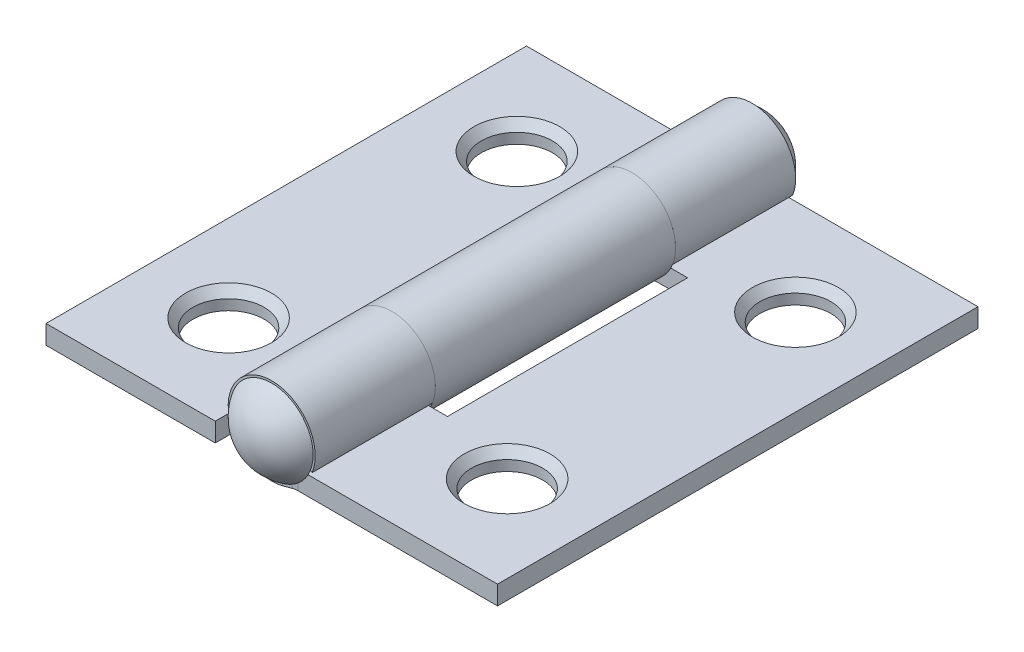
ISO-10303-21;
HEADER;
FILE_DESCRIPTION(('STEP AP214'),'2;1');
FILE_NAME('part.step','',(''),(''),'','','');
FILE_SCHEMA(('AUTOMOTIVE_DESIGN { 1 0 10303 214 1 1 1 1 }'));
ENDSEC;
DATA;
#1=APPLICATION_CONTEXT('core data for automotive mechanical design processes');
#2=APPLICATION_PROTOCOL_DEFINITION('international standard','automotive_design',2000,#1);
#3=PRODUCT_CONTEXT('',#1,'mechanical');
#4=PRODUCT('Part','Part','',(#3));
#5=PRODUCT_RELATED_PRODUCT_CATEGORY('part','',(#4));
#6=PRODUCT_DEFINITION_FORMATION('','',#4);
#7=PRODUCT_DEFINITION_CONTEXT('part definition',#1,'design');
#8=PRODUCT_DEFINITION('design','',#6,#7);
#9=PRODUCT_DEFINITION_SHAPE('','',#8);
#10=(LENGTH_UNIT() NAMED_UNIT(*) SI_UNIT(.MILLI.,.METRE.));
#11=(NAMED_UNIT(*) PLANE_ANGLE_UNIT() SI_UNIT($,.RADIAN.));
#12=(NAMED_UNIT(*) SI_UNIT($,.STERADIAN.) SOLID_ANGLE_UNIT());
#13=UNCERTAINTY_MEASURE_WITH_UNIT(LENGTH_MEASURE(1.E-05),#10,'distance_accuracy_value','');
#14=(GEOMETRIC_REPRESENTATION_CONTEXT(3) GLOBAL_UNCERTAINTY_ASSIGNED_CONTEXT((#13)) GLOBAL_UNIT_ASSIGNED_CONTEXT((#10,
#11,#12)) REPRESENTATION_CONTEXT('',''));
#15=CARTESIAN_POINT('',(0.,0.,0.));
#16=DIRECTION('',(0.,0.,1.));
#17=DIRECTION('',(1.,0.,0.));
#18=AXIS2_PLACEMENT_3D('',#15,#16,#17);
#19=CARTESIAN_POINT('',(3.05685889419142,3.23466654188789,14.3024204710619));
#20=DIRECTION('',(0.,0.,-1.));
#21=DIRECTION('',(0.679539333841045,0.73363907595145,0.));
#22=AXIS2_PLACEMENT_3D('',#19,#20,#21);
#23=CYLINDRICAL_SURFACE('',#22,1.30048);
#24=CARTESIAN_POINT('',(3.05685889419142,3.23466654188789,14.3024204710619));
#25=DIRECTION('',(0.,0.,1.));
#26=DIRECTION('',(-0.679539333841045,-0.73363907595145,0.));
#27=AXIS2_PLACEMENT_3D('',#24,#25,#26);
#28=CIRCLE('',#27,1.30048);
#29=CARTESIAN_POINT('',(2.17313158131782,2.28058359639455,14.3024204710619));
#30=VERTEX_POINT('',#29);
#31=EDGE_CURVE('P0_E11',#30,#30,#28,.T.);
#32=ORIENTED_EDGE('',*,*,#31,.F.);
#33=EDGE_LOOP('',(#32));
#34=FACE_BOUND('',#33,.T.);
#35=CARTESIAN_POINT('',(3.05685889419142,3.23466654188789,-11.0975795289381));
#36=DIRECTION('',(0.,0.,1.));
#37=DIRECTION('',(-0.73363907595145,0.679539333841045,0.));
#38=AXIS2_PLACEMENT_3D('',#35,#36,#37);
#39=CIRCLE('',#38,1.30048);
#40=CARTESIAN_POINT('',(2.10277594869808,4.1183938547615,-11.0975795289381));
#41=VERTEX_POINT('',#40);
#42=EDGE_CURVE('P0_E39',#41,#41,#39,.T.);
#43=ORIENTED_EDGE('',*,*,#42,.T.);
#44=EDGE_LOOP('',(#43));
#45=FACE_BOUND('',#44,.T.);
#46=ADVANCED_FACE('P0_F17',(#34,#45),#23,.T.);
#47=CARTESIAN_POINT('',(3.05685889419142,3.23466654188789,14.3024204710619));
#48=DIRECTION('',(0.,0.,-1.));
#49=DIRECTION('',(0.73363907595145,-0.679539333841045,0.));
#50=AXIS2_PLACEMENT_3D('',#47,#48,#49);
#51=PLANE('',#50);
#52=CARTESIAN_POINT('',(3.05685889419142,3.23466654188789,14.3024204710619));
#53=DIRECTION('',(0.,0.,-1.));
#54=DIRECTION('',(0.73363907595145,-0.679539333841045,0.));
#55=AXIS2_PLACEMENT_3D('',#52,#53,#54);
#56=CIRCLE('',#55,2.18948);
#57=CARTESIAN_POINT('',(4.6631469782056,1.7468287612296,14.3024204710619));
#58=VERTEX_POINT('',#57);
#59=EDGE_CURVE('P0_E24',#58,#58,#56,.T.);
#60=ORIENTED_EDGE('',*,*,#59,.T.);
#61=EDGE_LOOP('',(#60));
#62=FACE_BOUND('',#61,.T.);
#63=ORIENTED_EDGE('',*,*,#31,.T.);
#64=EDGE_LOOP('',(#63));
#65=FACE_BOUND('',#64,.T.);
#66=ADVANCED_FACE('P0_F46',(#62,#65),#51,.T.);
#67=CARTESIAN_POINT('',(3.03321275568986,3.25656897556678,12.9945219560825));
#68=DIRECTION('',(0.679539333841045,0.73363907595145,0.));
#69=DIRECTION('',(0.73363907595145,-0.679539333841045,0.));
#70=AXIS2_PLACEMENT_3D('',#67,#68,#69);
#71=CIRCLE('',#70,2.5781);
#72=TRIMMED_CURVE('',#71,(PARAMETER_VALUE(-1.55829404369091)),
(PARAMETER_VALUE(1.55829404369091)),.T.,.PARAMETER.);
#73=CARTESIAN_POINT('',(3.05685889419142,3.23466654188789,12.9945219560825));
#74=DIRECTION('',(0.,0.,-1.));
#75=AXIS1_PLACEMENT('',#73,#74);
#76=SURFACE_OF_REVOLUTION('',#72,#75);
#77=CARTESIAN_POINT('',(3.05685889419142,3.23466654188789,15.5724204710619));
#78=VERTEX_POINT('',#77);
#79=VERTEX_LOOP('',#78);
#80=FACE_BOUND('',#79,.T.);
#81=ORIENTED_EDGE('',*,*,#59,.F.);
#82=EDGE_LOOP('',(#81));
#83=FACE_BOUND('',#82,.T.);
#84=ADVANCED_FACE('P0_F49',(#80,#83),#76,.T.);
#85=CARTESIAN_POINT('',(3.05685889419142,3.23466654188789,-11.0975795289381));
#86=DIRECTION('',(0.,0.,1.));
#87=DIRECTION('',(0.73363907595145,-0.679539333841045,0.));
#88=AXIS2_PLACEMENT_3D('',#85,#86,#87);
#89=PLANE('',#88);
#90=CARTESIAN_POINT('',(3.05685889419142,3.23466654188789,-11.0975795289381));
#91=DIRECTION('',(0.,0.,-1.));
#92=DIRECTION('',(0.73363907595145,-0.679539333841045,0.));
#93=AXIS2_PLACEMENT_3D('',#90,#91,#92);
#94=CIRCLE('',#93,2.18948);
#95=CARTESIAN_POINT('',(4.6631469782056,1.7468287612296,-11.0975795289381));
#96=VERTEX_POINT('',#95);
#97=EDGE_CURVE('P0_E37',#96,#96,#94,.T.);
#98=ORIENTED_EDGE('',*,*,#97,.F.);
#99=EDGE_LOOP('',(#98));
#100=FACE_BOUND('',#99,.T.);
#101=ORIENTED_EDGE('',*,*,#42,.F.);
#102=EDGE_LOOP('',(#101));
#103=FACE_BOUND('',#102,.T.);
#104=ADVANCED_FACE('P0_F33',(#100,#103),#89,.T.);
#105=CARTESIAN_POINT('',(3.03321275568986,3.25656897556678,-9.78968101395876));
#106=DIRECTION('',(-0.679539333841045,-0.73363907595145,0.));
#107=DIRECTION('',(0.73363907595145,-0.679539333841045,0.));
#108=AXIS2_PLACEMENT_3D('',#105,#106,#107);
#109=CIRCLE('',#108,2.5781);
#110=TRIMMED_CURVE('',#109,(PARAMETER_VALUE(-1.55829404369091)),
(PARAMETER_VALUE(1.55829404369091)),.T.,.PARAMETER.);
#111=CARTESIAN_POINT('',(3.05685889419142,3.23466654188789,-9.78968101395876));
#112=DIRECTION('',(0.,0.,1.));
#113=AXIS1_PLACEMENT('',#111,#112);
#114=SURFACE_OF_REVOLUTION('',#110,#113);
#115=CARTESIAN_POINT('',(3.05685889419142,3.23466654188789,-12.3675795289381));
#116=VERTEX_POINT('',#115);
#117=VERTEX_LOOP('',#116);
#118=FACE_BOUND('',#117,.T.);
#119=ORIENTED_EDGE('',*,*,#97,.T.);
#120=EDGE_LOOP('',(#119));
#121=FACE_BOUND('',#120,.T.);
#122=ADVANCED_FACE('P0_F30',(#118,#121),#114,.T.);
#123=CLOSED_SHELL('',(#46,#66,#84,#104,#122));
#124=MANIFOLD_SOLID_BREP('P0_B1',#123);
#125=CARTESIAN_POINT('',(3.05685889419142,3.23466654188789,-11.0975795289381));
#126=DIRECTION('',(0.,0.,1.));
#127=DIRECTION('',(1.,0.,0.));
#128=AXIS2_PLACEMENT_3D('',#125,#126,#127);
#129=CYLINDRICAL_SURFACE('',#128,2.3);
#130=CARTESIAN_POINT('',(3.05685889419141,3.23466654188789,-4.74757952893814));
#131=DIRECTION('',(0.,0.,-1.));
#132=DIRECTION('',(-1.,0.,0.));
#133=AXIS2_PLACEMENT_3D('',#130,#131,#132);
#134=CIRCLE('',#133,2.3);
#135=CARTESIAN_POINT('',(3.65214269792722,1.01303714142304,-4.74757952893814));
#136=VERTEX_POINT('',#135);
#137=CARTESIAN_POINT('',(5.19817618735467,2.39516654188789,-4.74757952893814));
#138=VERTEX_POINT('',#137);
#139=EDGE_CURVE('P1_E272',#136,#138,#134,.T.);
#140=ORIENTED_EDGE('',*,*,#139,.T.);
#141=DIRECTION('',(0.,0.,1.));
#142=VECTOR('',#141,1.);
#143=CARTESIAN_POINT('',(5.19817618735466,2.39516654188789,-11.0975795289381));
#144=LINE('',#143,#142);
#145=CARTESIAN_POINT('',(5.19817618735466,2.39516654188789,-11.0975795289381));
#146=VERTEX_POINT('',#145);
#147=EDGE_CURVE('P1_E213',#146,#138,#144,.T.);
#148=ORIENTED_EDGE('',*,*,#147,.F.);
#149=CARTESIAN_POINT('',(3.05685889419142,3.23466654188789,-11.0975795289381));
#150=DIRECTION('',(0.,0.,-1.));
#151=DIRECTION('',(-1.,0.,0.));
#152=AXIS2_PLACEMENT_3D('',#149,#150,#151);
#153=CIRCLE('',#152,2.3);
#154=CARTESIAN_POINT('',(3.65214269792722,1.01303714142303,-11.0975795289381));
#155=VERTEX_POINT('',#154);
#156=EDGE_CURVE('P1_E90',#155,#146,#153,.T.);
#157=ORIENTED_EDGE('',*,*,#156,.F.);
#158=DIRECTION('',(0.,0.,1.));
#159=VECTOR('',#158,1.);
#160=CARTESIAN_POINT('',(3.65214269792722,1.01303714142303,-11.0975795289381));
#161=LINE('',#160,#159);
#162=EDGE_CURVE('P1_E188',#155,#136,#161,.T.);
#163=ORIENTED_EDGE('',*,*,#162,.T.);
#164=EDGE_LOOP('',(#140,#148,#157,#163));
#165=FACE_BOUND('',#164,.T.);
#166=ADVANCED_FACE('P1_F17',(#165),#129,.T.);
#167=CARTESIAN_POINT('',(4.26716866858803,2.76016654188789,-11.0975795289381));
#168=DIRECTION('',(-0.365,-0.931007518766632,0.));
#169=DIRECTION('',(-0.931007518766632,0.365,0.));
#170=AXIS2_PLACEMENT_3D('',#167,#168,#169);
#171=PLANE('',#170);
#172=DIRECTION('',(0.931007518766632,-0.365,0.));
#173=VECTOR('',#172,1.);
#174=CARTESIAN_POINT('',(4.26716866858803,2.76016654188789,-4.74757952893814));
#175=LINE('',#174,#173);
#176=CARTESIAN_POINT('',(4.26716866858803,2.76016654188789,-4.74757952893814));
#177=VERTEX_POINT('',#176);
#178=EDGE_CURVE('P1_E275',#177,#138,#175,.T.);
#179=ORIENTED_EDGE('',*,*,#178,.F.);
#180=DIRECTION('',(0.,0.,1.));
#181=VECTOR('',#180,1.);
#182=CARTESIAN_POINT('',(4.26716866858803,2.76016654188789,-11.0975795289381));
#183=LINE('',#182,#181);
#184=CARTESIAN_POINT('',(4.26716866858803,2.76016654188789,-11.0975795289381));
#185=VERTEX_POINT('',#184);
#186=EDGE_CURVE('P1_E209',#185,#177,#183,.T.);
#187=ORIENTED_EDGE('',*,*,#186,.F.);
#188=DIRECTION('',(0.931007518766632,-0.365,0.));
#189=VECTOR('',#188,1.);
#190=CARTESIAN_POINT('',(4.26716866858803,2.76016654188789,-11.0975795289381));
#191=LINE('',#190,#189);
#192=EDGE_CURVE('P1_E293',#185,#146,#191,.T.);
#193=ORIENTED_EDGE('',*,*,#192,.T.);
#194=ORIENTED_EDGE('',*,*,#147,.T.);
#195=EDGE_LOOP('',(#179,#187,#193,#194));
#196=FACE_BOUND('',#195,.T.);
#197=ADVANCED_FACE('P1_F361',(#196),#171,.T.);
#198=CARTESIAN_POINT('',(3.05685889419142,3.23466654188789,-11.0975795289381));
#199=DIRECTION('',(0.,0.,1.));
#200=DIRECTION('',(1.,0.,0.));
#201=AXIS2_PLACEMENT_3D('',#198,#199,#200);
#202=CYLINDRICAL_SURFACE('',#201,1.3);
#203=CARTESIAN_POINT('',(3.05685889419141,3.23466654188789,-4.74757952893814));
#204=DIRECTION('',(0.,0.,-1.));
#205=DIRECTION('',(-1.,0.,0.));
#206=AXIS2_PLACEMENT_3D('',#203,#204,#205);
#207=CIRCLE('',#206,1.3);
#208=CARTESIAN_POINT('',(3.3933236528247,1.9789629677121,-4.74757952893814));
#209=VERTEX_POINT('',#208);
#210=EDGE_CURVE('P1_E278',#209,#177,#207,.T.);
#211=ORIENTED_EDGE('',*,*,#210,.F.);
#212=DIRECTION('',(0.,0.,1.));
#213=VECTOR('',#212,1.);
#214=CARTESIAN_POINT('',(3.3933236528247,1.97896296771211,-11.0975795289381));
#215=LINE('',#214,#213);
#216=CARTESIAN_POINT('',(3.3933236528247,1.97896296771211,-11.0975795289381));
#217=VERTEX_POINT('',#216);
#218=EDGE_CURVE('P1_E205',#217,#209,#215,.T.);
#219=ORIENTED_EDGE('',*,*,#218,.F.);
#220=CARTESIAN_POINT('',(3.05685889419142,3.23466654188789,-11.0975795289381));
#221=DIRECTION('',(0.,0.,-1.));
#222=DIRECTION('',(-1.,0.,0.));
#223=AXIS2_PLACEMENT_3D('',#220,#221,#222);
#224=CIRCLE('',#223,1.3);
#225=EDGE_CURVE('P1_E296',#217,#185,#224,.T.);
#226=ORIENTED_EDGE('',*,*,#225,.T.);
#227=ORIENTED_EDGE('',*,*,#186,.T.);
#228=EDGE_LOOP('',(#211,#219,#226,#227));
#229=FACE_BOUND('',#228,.T.);
#230=ADVANCED_FACE('P1_F369',(#229),#202,.F.);
#231=CARTESIAN_POINT('',(3.90462550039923,2.11596588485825,-11.0975795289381));
#232=DIRECTION('',(-0.258819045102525,0.965925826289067,0.));
#233=DIRECTION('',(0.965925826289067,0.258819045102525,0.));
#234=AXIS2_PLACEMENT_3D('',#231,#232,#233);
#235=PLANE('',#234);
#236=DIRECTION('',(-0.965925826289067,-0.258819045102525,0.));
#237=VECTOR('',#236,1.);
#238=CARTESIAN_POINT('',(3.90462550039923,2.11596588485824,-4.74757952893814));
#239=LINE('',#238,#237);
#240=CARTESIAN_POINT('',(3.90462550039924,2.11596588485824,-4.74757952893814));
#241=VERTEX_POINT('',#240);
#242=EDGE_CURVE('P1_E281',#241,#209,#239,.T.);
#243=ORIENTED_EDGE('',*,*,#242,.F.);
#244=DIRECTION('',(0.,0.,1.));
#245=VECTOR('',#244,1.);
#246=CARTESIAN_POINT('',(3.90462550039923,2.11596588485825,-11.0975795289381));
#247=LINE('',#246,#245);
#248=CARTESIAN_POINT('',(3.90462550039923,2.11596588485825,-11.0975795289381));
#249=VERTEX_POINT('',#248);
#250=EDGE_CURVE('P1_E201',#249,#241,#247,.T.);
#251=ORIENTED_EDGE('',*,*,#250,.F.);
#252=DIRECTION('',(-0.965925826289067,-0.258819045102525,0.));
#253=VECTOR('',#252,1.);
#254=CARTESIAN_POINT('',(3.90462550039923,2.11596588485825,-11.0975795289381));
#255=LINE('',#254,#253);
#256=EDGE_CURVE('P1_E299',#249,#217,#255,.T.);
#257=ORIENTED_EDGE('',*,*,#256,.T.);
#258=ORIENTED_EDGE('',*,*,#218,.T.);
#259=EDGE_LOOP('',(#243,#251,#257,#258));
#260=FACE_BOUND('',#259,.T.);
#261=ADVANCED_FACE('P1_F387',(#260),#235,.T.);
#262=CARTESIAN_POINT('',(4.45684181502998,0.055066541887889,-11.0975795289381));
#263=DIRECTION('',(0.,0.,1.));
#264=DIRECTION('',(1.,0.,0.));
#265=AXIS2_PLACEMENT_3D('',#262,#263,#264);
#266=CYLINDRICAL_SURFACE('',#265,2.1336);
#267=CARTESIAN_POINT('',(4.45684181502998,0.0550665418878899,-4.74757952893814));
#268=DIRECTION('',(0.,0.,-1.));
#269=DIRECTION('',(-1.,0.,0.));
#270=AXIS2_PLACEMENT_3D('',#267,#268,#269);
#271=CIRCLE('',#270,2.1336);
#272=CARTESIAN_POINT('',(4.45684181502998,2.18866654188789,-4.74757952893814));
#273=VERTEX_POINT('',#272);
#274=EDGE_CURVE('P1_E284',#273,#241,#271,.F.);
#275=ORIENTED_EDGE('',*,*,#274,.F.);
#276=DIRECTION('',(0.,0.,1.));
#277=VECTOR('',#276,1.);
#278=CARTESIAN_POINT('',(4.45684181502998,2.18866654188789,-11.0975795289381));
#279=LINE('',#278,#277);
#280=CARTESIAN_POINT('',(4.45684181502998,2.18866654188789,-11.0975795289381));
#281=VERTEX_POINT('',#280);
#282=EDGE_CURVE('P1_E197',#281,#273,#279,.T.);
#283=ORIENTED_EDGE('',*,*,#282,.F.);
#284=CARTESIAN_POINT('',(4.45684181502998,0.055066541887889,-11.0975795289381));
#285=DIRECTION('',(0.,0.,1.));
#286=DIRECTION('',(-1.,0.,0.));
#287=AXIS2_PLACEMENT_3D('',#284,#285,#286);
#288=CIRCLE('',#287,2.1336);
#289=EDGE_CURVE('P1_E120',#281,#249,#288,.T.);
#290=ORIENTED_EDGE('',*,*,#289,.T.);
#291=ORIENTED_EDGE('',*,*,#250,.T.);
#292=EDGE_LOOP('',(#275,#283,#290,#291));
#293=FACE_BOUND('',#292,.T.);
#294=ADVANCED_FACE('P1_F427',(#293),#266,.T.);
#295=CARTESIAN_POINT('',(4.45684181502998,0.055066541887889,-11.0975795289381));
#296=DIRECTION('',(0.,0.,1.));
#297=DIRECTION('',(1.,0.,0.));
#298=AXIS2_PLACEMENT_3D('',#295,#296,#297);
#299=CYLINDRICAL_SURFACE('',#298,1.1336);
#300=DIRECTION('',(0.,0.,1.));
#301=VECTOR('',#300,1.);
#302=CARTESIAN_POINT('',(4.45684181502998,1.18866654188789,-11.0975795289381));
#303=LINE('',#302,#301);
#304=CARTESIAN_POINT('',(4.45684181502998,1.18866654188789,-11.0975795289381));
#305=VERTEX_POINT('',#304);
#306=CARTESIAN_POINT('',(4.45684181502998,1.1886665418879,-4.74757952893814));
#307=VERTEX_POINT('',#306);
#308=EDGE_CURVE('P1_E139',#305,#307,#303,.T.);
#309=ORIENTED_EDGE('',*,*,#308,.T.);
#310=CARTESIAN_POINT('',(4.45684181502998,0.0550665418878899,-4.74757952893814));
#311=DIRECTION('',(0.,0.,-1.));
#312=DIRECTION('',(-1.,0.,0.));
#313=AXIS2_PLACEMENT_3D('',#310,#311,#312);
#314=CIRCLE('',#313,1.1336);
#315=CARTESIAN_POINT('',(4.16344454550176,1.15004005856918,-4.74757952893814));
#316=VERTEX_POINT('',#315);
#317=EDGE_CURVE('P1_E269',#307,#316,#314,.F.);
#318=ORIENTED_EDGE('',*,*,#317,.T.);
#319=DIRECTION('',(0.,0.,1.));
#320=VECTOR('',#319,1.);
#321=CARTESIAN_POINT('',(4.16344454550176,1.15004005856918,-11.0975795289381));
#322=LINE('',#321,#320);
#323=CARTESIAN_POINT('',(4.16344454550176,1.15004005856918,-11.0975795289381));
#324=VERTEX_POINT('',#323);
#325=EDGE_CURVE('P1_E151',#324,#316,#322,.T.);
#326=ORIENTED_EDGE('',*,*,#325,.F.);
#327=CARTESIAN_POINT('',(4.45684181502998,0.055066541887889,-11.0975795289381));
#328=DIRECTION('',(0.,0.,-1.));
#329=DIRECTION('',(-1.,0.,0.));
#330=AXIS2_PLACEMENT_3D('',#327,#328,#329);
#331=CIRCLE('',#330,1.1336);
#332=EDGE_CURVE('P1_E117',#305,#324,#331,.F.);
#333=ORIENTED_EDGE('',*,*,#332,.F.);
#334=EDGE_LOOP('',(#309,#318,#326,#333));
#335=FACE_BOUND('',#334,.T.);
#336=ADVANCED_FACE('P1_F149',(#335),#299,.F.);
#337=CARTESIAN_POINT('',(4.16344454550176,1.15004005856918,-11.0975795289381));
#338=DIRECTION('',(-0.258819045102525,0.965925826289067,0.));
#339=DIRECTION('',(0.965925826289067,0.258819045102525,0.));
#340=AXIS2_PLACEMENT_3D('',#337,#338,#339);
#341=PLANE('',#340);
#342=ORIENTED_EDGE('',*,*,#325,.T.);
#343=DIRECTION('',(-0.965925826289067,-0.258819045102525,0.));
#344=VECTOR('',#343,1.);
#345=CARTESIAN_POINT('',(4.16344454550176,1.15004005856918,-4.74757952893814));
#346=LINE('',#345,#344);
#347=EDGE_CURVE('P1_E26',#316,#136,#346,.T.);
#348=ORIENTED_EDGE('',*,*,#347,.T.);
#349=ORIENTED_EDGE('',*,*,#162,.F.);
#350=DIRECTION('',(-0.965925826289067,-0.258819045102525,0.));
#351=VECTOR('',#350,1.);
#352=CARTESIAN_POINT('',(4.16344454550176,1.15004005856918,-11.0975795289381));
#353=LINE('',#352,#351);
#354=EDGE_CURVE('P1_E153',#324,#155,#353,.T.);
#355=ORIENTED_EDGE('',*,*,#354,.F.);
#356=EDGE_LOOP('',(#342,#348,#349,#355));
#357=FACE_BOUND('',#356,.T.);
#358=ADVANCED_FACE('P1_F431',(#357),#341,.F.);
#359=CARTESIAN_POINT('',(3.90462550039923,2.11596588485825,-11.0975795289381));
#360=DIRECTION('',(0.,0.,-1.));
#361=DIRECTION('',(-1.,0.,0.));
#362=AXIS2_PLACEMENT_3D('',#359,#360,#361);
#363=PLANE('',#362);
#364=DIRECTION('',(0.258819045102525,-0.965925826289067,0.));
#365=VECTOR('',#364,1.);
#366=CARTESIAN_POINT('',(3.90462550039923,2.11596588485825,-11.0975795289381));
#367=LINE('',#366,#365);
#368=EDGE_CURVE('P1_E125',#249,#324,#367,.T.);
#369=ORIENTED_EDGE('',*,*,#368,.F.);
#370=ORIENTED_EDGE('',*,*,#289,.F.);
#371=DIRECTION('',(0.,1.,0.));
#372=VECTOR('',#371,1.);
#373=CARTESIAN_POINT('',(4.45684181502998,1.18866654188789,-11.0975795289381));
#374=LINE('',#373,#372);
#375=EDGE_CURVE('P1_E114',#305,#281,#374,.T.);
#376=ORIENTED_EDGE('',*,*,#375,.F.);
#377=ORIENTED_EDGE('',*,*,#332,.T.);
#378=EDGE_LOOP('',(#369,#370,#376,#377));
#379=FACE_BOUND('',#378,.T.);
#380=ADVANCED_FACE('P1_F19',(#379),#363,.T.);
#381=CARTESIAN_POINT('',(4.45684181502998,1.18866654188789,-11.0975795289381));
#382=DIRECTION('',(0.,0.,-1.));
#383=DIRECTION('',(-1.,0.,0.));
#384=AXIS2_PLACEMENT_3D('',#381,#382,#383);
#385=PLANE('',#384);
#386=ORIENTED_EDGE('',*,*,#256,.F.);
#387=ORIENTED_EDGE('',*,*,#368,.T.);
#388=ORIENTED_EDGE('',*,*,#354,.T.);
#389=DIRECTION('',(-0.258819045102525,0.965925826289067,0.));
#390=VECTOR('',#389,1.);
#391=CARTESIAN_POINT('',(3.65214269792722,1.01303714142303,-11.0975795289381));
#392=LINE('',#391,#390);
#393=EDGE_CURVE('P1_E43',#155,#217,#392,.T.);
#394=ORIENTED_EDGE('',*,*,#393,.T.);
#395=EDGE_LOOP('',(#386,#387,#388,#394));
#396=FACE_BOUND('',#395,.T.);
#397=ADVANCED_FACE('P1_F429',(#396),#385,.T.);
#398=CARTESIAN_POINT('',(4.45684181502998,2.1886665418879,14.3024204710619));
#399=DIRECTION('',(0.,0.,1.));
#400=DIRECTION('',(1.,0.,0.));
#401=AXIS2_PLACEMENT_3D('',#398,#399,#400);
#402=PLANE('',#401);
#403=DIRECTION('',(0.,-1.,0.));
#404=VECTOR('',#403,1.);
#405=CARTESIAN_POINT('',(4.45684181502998,2.1886665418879,14.3024204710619));
#406=LINE('',#405,#404);
#407=CARTESIAN_POINT('',(4.45684181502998,2.1886665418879,14.3024204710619));
#408=VERTEX_POINT('',#407);
#409=CARTESIAN_POINT('',(4.45684181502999,1.1886665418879,14.3024204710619));
#410=VERTEX_POINT('',#409);
#411=EDGE_CURVE('P1_E126',#408,#410,#406,.T.);
#412=ORIENTED_EDGE('',*,*,#411,.F.);
#413=CARTESIAN_POINT('',(4.45684181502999,0.0550665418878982,14.3024204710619));
#414=DIRECTION('',(0.,0.,1.));
#415=DIRECTION('',(-1.,0.,0.));
#416=AXIS2_PLACEMENT_3D('',#413,#414,#415);
#417=CIRCLE('',#416,2.1336);
#418=CARTESIAN_POINT('',(3.90462550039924,2.11596588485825,14.3024204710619));
#419=VERTEX_POINT('',#418);
#420=EDGE_CURVE('P1_E170',#408,#419,#417,.T.);
#421=ORIENTED_EDGE('',*,*,#420,.T.);
#422=DIRECTION('',(-0.258819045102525,0.965925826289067,0.));
#423=VECTOR('',#422,1.);
#424=CARTESIAN_POINT('',(4.16344454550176,1.15004005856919,14.3024204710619));
#425=LINE('',#424,#423);
#426=CARTESIAN_POINT('',(4.16344454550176,1.15004005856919,14.3024204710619));
#427=VERTEX_POINT('',#426);
#428=EDGE_CURVE('P1_E219',#427,#419,#425,.T.);
#429=ORIENTED_EDGE('',*,*,#428,.F.);
#430=CARTESIAN_POINT('',(4.45684181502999,0.0550665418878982,14.3024204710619));
#431=DIRECTION('',(0.,0.,-1.));
#432=DIRECTION('',(-1.,0.,0.));
#433=AXIS2_PLACEMENT_3D('',#430,#431,#432);
#434=CIRCLE('',#433,1.1336);
#435=EDGE_CURVE('P1_E182',#410,#427,#434,.F.);
#436=ORIENTED_EDGE('',*,*,#435,.F.);
#437=EDGE_LOOP('',(#412,#421,#429,#436));
#438=FACE_BOUND('',#437,.T.);
#439=ADVANCED_FACE('P1_F316',(#438),#402,.T.);
#440=CARTESIAN_POINT('',(4.16344454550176,1.15004005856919,14.3024204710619));
#441=DIRECTION('',(0.,0.,1.));
#442=DIRECTION('',(1.,0.,0.));
#443=AXIS2_PLACEMENT_3D('',#440,#441,#442);
#444=PLANE('',#443);
#445=DIRECTION('',(-1.,0.,0.));
#446=VECTOR('',#445,1.);
#447=CARTESIAN_POINT('',(14.9948588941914,2.1886665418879,14.3024204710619));
#448=LINE('',#447,#446);
#449=CARTESIAN_POINT('',(14.9948588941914,2.1886665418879,14.3024204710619));
#450=VERTEX_POINT('',#449);
#451=EDGE_CURVE('P1_E173',#450,#408,#448,.T.);
#452=ORIENTED_EDGE('',*,*,#451,.T.);
#453=ORIENTED_EDGE('',*,*,#411,.T.);
#454=DIRECTION('',(-1.,0.,0.));
#455=VECTOR('',#454,1.);
#456=CARTESIAN_POINT('',(14.9948588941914,1.1886665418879,14.3024204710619));
#457=LINE('',#456,#455);
#458=CARTESIAN_POINT('',(14.9948588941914,1.1886665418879,14.3024204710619));
#459=VERTEX_POINT('',#458);
#460=EDGE_CURVE('P1_E179',#459,#410,#457,.T.);
#461=ORIENTED_EDGE('',*,*,#460,.F.);
#462=DIRECTION('',(0.,1.,0.));
#463=VECTOR('',#462,1.);
#464=CARTESIAN_POINT('',(14.9948588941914,1.1886665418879,14.3024204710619));
#465=LINE('',#464,#463);
#466=EDGE_CURVE('P1_E176',#459,#450,#465,.T.);
#467=ORIENTED_EDGE('',*,*,#466,.T.);
#468=EDGE_LOOP('',(#452,#453,#461,#467));
#469=FACE_BOUND('',#468,.T.);
#470=ADVANCED_FACE('P1_F312',(#469),#444,.T.);
#471=CARTESIAN_POINT('',(3.65214269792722,1.01303714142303,-11.0975795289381));
#472=DIRECTION('',(0.,0.,-1.));
#473=DIRECTION('',(-1.,0.,0.));
#474=AXIS2_PLACEMENT_3D('',#471,#472,#473);
#475=PLANE('',#474);
#476=ORIENTED_EDGE('',*,*,#393,.F.);
#477=ORIENTED_EDGE('',*,*,#156,.T.);
#478=ORIENTED_EDGE('',*,*,#192,.F.);
#479=ORIENTED_EDGE('',*,*,#225,.F.);
#480=EDGE_LOOP('',(#476,#477,#478,#479));
#481=FACE_BOUND('',#480,.T.);
#482=ADVANCED_FACE('P1_F362',(#481),#475,.T.);
#483=CARTESIAN_POINT('',(3.3933236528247,1.97896296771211,14.3024204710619));
#484=DIRECTION('',(0.,0.,1.));
#485=DIRECTION('',(1.,0.,0.));
#486=AXIS2_PLACEMENT_3D('',#483,#484,#485);
#487=PLANE('',#486);
#488=DIRECTION('',(0.258819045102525,-0.965925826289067,0.));
#489=VECTOR('',#488,1.);
#490=CARTESIAN_POINT('',(3.3933236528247,1.97896296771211,14.3024204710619));
#491=LINE('',#490,#489);
#492=CARTESIAN_POINT('',(3.3933236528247,1.97896296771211,14.3024204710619));
#493=VERTEX_POINT('',#492);
#494=CARTESIAN_POINT('',(3.65214269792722,1.01303714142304,14.3024204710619));
#495=VERTEX_POINT('',#494);
#496=EDGE_CURVE('P1_E216',#493,#495,#491,.T.);
#497=ORIENTED_EDGE('',*,*,#496,.F.);
#498=CARTESIAN_POINT('',(3.05685889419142,3.2346665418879,14.3024204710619));
#499=DIRECTION('',(0.,0.,-1.));
#500=DIRECTION('',(-1.,0.,0.));
#501=AXIS2_PLACEMENT_3D('',#498,#499,#500);
#502=CIRCLE('',#501,1.3);
#503=CARTESIAN_POINT('',(4.26716866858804,2.7601665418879,14.3024204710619));
#504=VERTEX_POINT('',#503);
#505=EDGE_CURVE('P1_E164',#493,#504,#502,.T.);
#506=ORIENTED_EDGE('',*,*,#505,.T.);
#507=DIRECTION('',(0.931007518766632,-0.365,0.));
#508=VECTOR('',#507,1.);
#509=CARTESIAN_POINT('',(4.26716866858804,2.7601665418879,14.3024204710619));
#510=LINE('',#509,#508);
#511=CARTESIAN_POINT('',(5.19817618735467,2.3951665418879,14.3024204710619));
#512=VERTEX_POINT('',#511);
#513=EDGE_CURVE('P1_E160',#504,#512,#510,.T.);
#514=ORIENTED_EDGE('',*,*,#513,.T.);
#515=CARTESIAN_POINT('',(3.05685889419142,3.2346665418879,14.3024204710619));
#516=DIRECTION('',(0.,0.,-1.));
#517=DIRECTION('',(-1.,0.,0.));
#518=AXIS2_PLACEMENT_3D('',#515,#516,#517);
#519=CIRCLE('',#518,2.3);
#520=EDGE_CURVE('P1_E158',#495,#512,#519,.T.);
#521=ORIENTED_EDGE('',*,*,#520,.F.);
#522=EDGE_LOOP('',(#497,#506,#514,#521));
#523=FACE_BOUND('',#522,.T.);
#524=ADVANCED_FACE('P1_F340',(#523),#487,.T.);
#525=CARTESIAN_POINT('',(3.05685889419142,3.2346665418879,7.95242047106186));
#526=DIRECTION('',(0.,0.,1.));
#527=DIRECTION('',(1.,0.,0.));
#528=AXIS2_PLACEMENT_3D('',#525,#526,#527);
#529=CIRCLE('',#528,2.3);
#530=CARTESIAN_POINT('',(5.19817618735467,2.3951665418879,7.95242047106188));
#531=VERTEX_POINT('',#530);
#532=CARTESIAN_POINT('',(3.65214269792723,1.01303714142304,7.95242047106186));
#533=VERTEX_POINT('',#532);
#534=EDGE_CURVE('P1_E252',#531,#533,#529,.T.);
#535=ORIENTED_EDGE('',*,*,#534,.T.);
#536=EDGE_CURVE('P1_E84',#533,#495,#161,.T.);
#537=ORIENTED_EDGE('',*,*,#536,.T.);
#538=ORIENTED_EDGE('',*,*,#520,.T.);
#539=EDGE_CURVE('P1_E212',#531,#512,#144,.T.);
#540=ORIENTED_EDGE('',*,*,#539,.F.);
#541=EDGE_LOOP('',(#535,#537,#538,#540));
#542=FACE_BOUND('',#541,.T.);
#543=ADVANCED_FACE('P1_F350',(#542),#129,.T.);
#544=DIRECTION('',(-0.931007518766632,0.365,0.));
#545=VECTOR('',#544,1.);
#546=CARTESIAN_POINT('',(4.26716866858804,2.7601665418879,7.95242047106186));
#547=LINE('',#546,#545);
#548=CARTESIAN_POINT('',(4.26716866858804,2.7601665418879,7.95242047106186));
#549=VERTEX_POINT('',#548);
#550=EDGE_CURVE('P1_E254',#531,#549,#547,.T.);
#551=ORIENTED_EDGE('',*,*,#550,.F.);
#552=ORIENTED_EDGE('',*,*,#539,.T.);
#553=ORIENTED_EDGE('',*,*,#513,.F.);
#554=EDGE_CURVE('P1_E208',#549,#504,#183,.T.);
#555=ORIENTED_EDGE('',*,*,#554,.F.);
#556=EDGE_LOOP('',(#551,#552,#553,#555));
#557=FACE_BOUND('',#556,.T.);
#558=ADVANCED_FACE('P1_F347',(#557),#171,.T.);
#559=CARTESIAN_POINT('',(3.05685889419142,3.2346665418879,7.95242047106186));
#560=DIRECTION('',(0.,0.,1.));
#561=DIRECTION('',(1.,0.,0.));
#562=AXIS2_PLACEMENT_3D('',#559,#560,#561);
#563=CIRCLE('',#562,1.3);
#564=CARTESIAN_POINT('',(3.3933236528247,1.97896296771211,7.95242047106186));
#565=VERTEX_POINT('',#564);
#566=EDGE_CURVE('P1_E257',#549,#565,#563,.T.);
#567=ORIENTED_EDGE('',*,*,#566,.F.);
#568=ORIENTED_EDGE('',*,*,#554,.T.);
#569=ORIENTED_EDGE('',*,*,#505,.F.);
#570=EDGE_CURVE('P1_E204',#565,#493,#215,.T.);
#571=ORIENTED_EDGE('',*,*,#570,.F.);
#572=EDGE_LOOP('',(#567,#568,#569,#571));
#573=FACE_BOUND('',#572,.T.);
#574=ADVANCED_FACE('P1_F341',(#573),#202,.F.);
#575=DIRECTION('',(0.965925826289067,0.258819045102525,0.));
#576=VECTOR('',#575,1.);
#577=CARTESIAN_POINT('',(3.90462550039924,2.11596588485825,7.95242047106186));
#578=LINE('',#577,#576);
#579=CARTESIAN_POINT('',(3.90462550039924,2.11596588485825,7.95242047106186));
#580=VERTEX_POINT('',#579);
#581=EDGE_CURVE('P1_E260',#565,#580,#578,.T.);
#582=ORIENTED_EDGE('',*,*,#581,.F.);
#583=ORIENTED_EDGE('',*,*,#570,.T.);
#584=DIRECTION('',(-0.965925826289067,-0.258819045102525,0.));
#585=VECTOR('',#584,1.);
#586=CARTESIAN_POINT('',(3.90462550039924,2.11596588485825,14.3024204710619));
#587=LINE('',#586,#585);
#588=EDGE_CURVE('P1_E167',#419,#493,#587,.T.);
#589=ORIENTED_EDGE('',*,*,#588,.F.);
#590=EDGE_CURVE('P1_E200',#580,#419,#247,.T.);
#591=ORIENTED_EDGE('',*,*,#590,.F.);
#592=EDGE_LOOP('',(#582,#583,#589,#591));
#593=FACE_BOUND('',#592,.T.);
#594=ADVANCED_FACE('P1_F331',(#593),#235,.T.);
#595=CARTESIAN_POINT('',(4.45684181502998,0.0550665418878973,7.95242047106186));
#596=DIRECTION('',(0.,0.,1.));
#597=DIRECTION('',(1.,0.,0.));
#598=AXIS2_PLACEMENT_3D('',#595,#596,#597);
#599=CIRCLE('',#598,2.1336);
#600=CARTESIAN_POINT('',(4.45684181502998,2.1886665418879,7.95242047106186));
#601=VERTEX_POINT('',#600);
#602=EDGE_CURVE('P1_E263',#580,#601,#599,.F.);
#603=ORIENTED_EDGE('',*,*,#602,.F.);
#604=ORIENTED_EDGE('',*,*,#590,.T.);
#605=ORIENTED_EDGE('',*,*,#420,.F.);
#606=EDGE_CURVE('P1_E196',#601,#408,#279,.T.);
#607=ORIENTED_EDGE('',*,*,#606,.F.);
#608=EDGE_LOOP('',(#603,#604,#605,#607));
#609=FACE_BOUND('',#608,.T.);
#610=ADVANCED_FACE('P1_F321',(#609),#266,.T.);
#611=CARTESIAN_POINT('',(14.9948588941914,2.18866654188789,-11.0975795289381));
#612=DIRECTION('',(0.,1.,0.));
#613=DIRECTION('',(0.,0.,-1.));
#614=AXIS2_PLACEMENT_3D('',#611,#612,#613);
#615=PLANE('',#614);
#616=CARTESIAN_POINT('',(10.4228588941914,2.1886665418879,-6.01757952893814));
#617=DIRECTION('',(0.,1.,0.));
#618=DIRECTION('',(0.,0.,-1.));
#619=AXIS2_PLACEMENT_3D('',#616,#617,#618);
#620=CIRCLE('',#619,2.2733);
#621=CARTESIAN_POINT('',(10.4228588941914,2.1886665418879,-8.29087952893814));
#622=VERTEX_POINT('',#621);
#623=EDGE_CURVE('P1_E678',#622,#622,#620,.T.);
#624=ORIENTED_EDGE('',*,*,#623,.F.);
#625=EDGE_LOOP('',(#624));
#626=FACE_BOUND('',#625,.T.);
#627=CARTESIAN_POINT('',(10.4228588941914,2.18866654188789,9.22242047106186));
#628=DIRECTION('',(0.,1.,0.));
#629=DIRECTION('',(0.,0.,-1.));
#630=AXIS2_PLACEMENT_3D('',#627,#628,#629);
#631=CIRCLE('',#630,2.2733);
#632=CARTESIAN_POINT('',(10.4228588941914,2.18866654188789,6.94912047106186));
#633=VERTEX_POINT('',#632);
#634=EDGE_CURVE('P1_E238',#633,#633,#631,.T.);
#635=ORIENTED_EDGE('',*,*,#634,.F.);
#636=EDGE_LOOP('',(#635));
#637=FACE_BOUND('',#636,.T.);
#638=DIRECTION('',(-1.,0.,0.));
#639=VECTOR('',#638,1.);
#640=CARTESIAN_POINT('',(14.9948588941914,2.18866654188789,-4.74757952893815));
#641=LINE('',#640,#639);
#642=CARTESIAN_POINT('',(5.99817618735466,2.18866654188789,-4.74757952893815));
#643=VERTEX_POINT('',#642);
#644=EDGE_CURVE('P1_E287',#643,#273,#641,.T.);
#645=ORIENTED_EDGE('',*,*,#644,.F.);
#646=DIRECTION('',(0.,0.,-1.));
#647=VECTOR('',#646,1.);
#648=CARTESIAN_POINT('',(5.99817618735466,2.18866654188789,-11.0975795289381));
#649=LINE('',#648,#647);
#650=CARTESIAN_POINT('',(5.99817618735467,2.1886665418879,7.95242047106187));
#651=VERTEX_POINT('',#650);
#652=EDGE_CURVE('P1_E161',#651,#643,#649,.T.);
#653=ORIENTED_EDGE('',*,*,#652,.F.);
#654=DIRECTION('',(1.,0.,0.));
#655=VECTOR('',#654,1.);
#656=CARTESIAN_POINT('',(14.9948588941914,2.1886665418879,7.95242047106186));
#657=LINE('',#656,#655);
#658=EDGE_CURVE('P1_E266',#601,#651,#657,.T.);
#659=ORIENTED_EDGE('',*,*,#658,.F.);
#660=ORIENTED_EDGE('',*,*,#606,.T.);
#661=ORIENTED_EDGE('',*,*,#451,.F.);
#662=DIRECTION('',(0.,0.,1.));
#663=VECTOR('',#662,1.);
#664=CARTESIAN_POINT('',(14.9948588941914,2.18866654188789,-11.0975795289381));
#665=LINE('',#664,#663);
#666=CARTESIAN_POINT('',(14.9948588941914,2.18866654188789,-11.0975795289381));
#667=VERTEX_POINT('',#666);
#668=EDGE_CURVE('P1_E194',#667,#450,#665,.T.);
#669=ORIENTED_EDGE('',*,*,#668,.F.);
#670=DIRECTION('',(-1.,0.,0.));
#671=VECTOR('',#670,1.);
#672=CARTESIAN_POINT('',(14.9948588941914,2.18866654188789,-11.0975795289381));
#673=LINE('',#672,#671);
#674=EDGE_CURVE('P1_E303',#667,#281,#673,.T.);
#675=ORIENTED_EDGE('',*,*,#674,.T.);
#676=ORIENTED_EDGE('',*,*,#282,.T.);
#677=EDGE_LOOP('',(#645,#653,#659,#660,#661,#669,#675,#676));
#678=FACE_BOUND('',#677,.T.);
#679=ADVANCED_FACE('P1_F424',(#626,#637,#678),#615,.T.);
#680=CARTESIAN_POINT('',(14.9948588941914,1.18866654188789,-11.0975795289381));
#681=DIRECTION('',(1.,0.,0.));
#682=DIRECTION('',(0.,0.,-1.));
#683=AXIS2_PLACEMENT_3D('',#680,#681,#682);
#684=PLANE('',#683);
#685=ORIENTED_EDGE('',*,*,#466,.F.);
#686=DIRECTION('',(0.,0.,1.));
#687=VECTOR('',#686,1.);
#688=CARTESIAN_POINT('',(14.9948588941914,1.18866654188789,-11.0975795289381));
#689=LINE('',#688,#687);
#690=CARTESIAN_POINT('',(14.9948588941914,1.18866654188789,-11.0975795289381));
#691=VERTEX_POINT('',#690);
#692=EDGE_CURVE('P1_E146',#691,#459,#689,.T.);
#693=ORIENTED_EDGE('',*,*,#692,.F.);
#694=DIRECTION('',(0.,1.,0.));
#695=VECTOR('',#694,1.);
#696=CARTESIAN_POINT('',(14.9948588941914,1.18866654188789,-11.0975795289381));
#697=LINE('',#696,#695);
#698=EDGE_CURVE('P1_E134',#691,#667,#697,.T.);
#699=ORIENTED_EDGE('',*,*,#698,.T.);
#700=ORIENTED_EDGE('',*,*,#668,.T.);
#701=EDGE_LOOP('',(#685,#693,#699,#700));
#702=FACE_BOUND('',#701,.T.);
#703=ADVANCED_FACE('P1_F306',(#702),#684,.T.);
#704=CARTESIAN_POINT('',(14.9948588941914,1.18866654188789,-11.0975795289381));
#705=DIRECTION('',(0.,1.,0.));
#706=DIRECTION('',(0.,0.,-1.));
#707=AXIS2_PLACEMENT_3D('',#704,#705,#706);
#708=PLANE('',#707);
#709=CARTESIAN_POINT('',(10.4228588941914,1.1886665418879,-6.01757952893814));
#710=DIRECTION('',(0.,1.,0.));
#711=DIRECTION('',(0.,0.,-1.));
#712=AXIS2_PLACEMENT_3D('',#709,#710,#711);
#713=CIRCLE('',#712,1.8796);
#714=CARTESIAN_POINT('',(10.4228588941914,1.1886665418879,-7.89717952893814));
#715=VERTEX_POINT('',#714);
#716=EDGE_CURVE('P1_E21',#715,#715,#713,.T.);
#717=ORIENTED_EDGE('',*,*,#716,.T.);
#718=EDGE_LOOP('',(#717));
#719=FACE_BOUND('',#718,.T.);
#720=CARTESIAN_POINT('',(10.4228588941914,1.1886665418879,9.22242047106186));
#721=DIRECTION('',(0.,1.,0.));
#722=DIRECTION('',(0.,0.,-1.));
#723=AXIS2_PLACEMENT_3D('',#720,#721,#722);
#724=CIRCLE('',#723,1.8796);
#725=CARTESIAN_POINT('',(10.4228588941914,1.1886665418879,7.34282047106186));
#726=VERTEX_POINT('',#725);
#727=EDGE_CURVE('P1_E228',#726,#726,#724,.T.);
#728=ORIENTED_EDGE('',*,*,#727,.T.);
#729=EDGE_LOOP('',(#728));
#730=FACE_BOUND('',#729,.T.);
#731=DIRECTION('',(0.,0.,-1.));
#732=VECTOR('',#731,1.);
#733=CARTESIAN_POINT('',(5.99817618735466,1.18866654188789,-11.0975795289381));
#734=LINE('',#733,#732);
#735=CARTESIAN_POINT('',(5.99817618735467,1.1886665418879,7.95242047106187));
#736=VERTEX_POINT('',#735);
#737=CARTESIAN_POINT('',(5.99817618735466,1.1886665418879,-4.74757952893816));
#738=VERTEX_POINT('',#737);
#739=EDGE_CURVE('P1_E11',#736,#738,#734,.T.);
#740=ORIENTED_EDGE('',*,*,#739,.T.);
#741=DIRECTION('',(-1.,0.,0.));
#742=VECTOR('',#741,1.);
#743=CARTESIAN_POINT('',(14.9948588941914,1.1886665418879,-4.74757952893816));
#744=LINE('',#743,#742);
#745=EDGE_CURVE('P1_E143',#738,#307,#744,.T.);
#746=ORIENTED_EDGE('',*,*,#745,.T.);
#747=ORIENTED_EDGE('',*,*,#308,.F.);
#748=DIRECTION('',(-1.,0.,0.));
#749=VECTOR('',#748,1.);
#750=CARTESIAN_POINT('',(14.9948588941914,1.18866654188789,-11.0975795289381));
#751=LINE('',#750,#749);
#752=EDGE_CURVE('P1_E130',#691,#305,#751,.T.);
#753=ORIENTED_EDGE('',*,*,#752,.F.);
#754=ORIENTED_EDGE('',*,*,#692,.T.);
#755=ORIENTED_EDGE('',*,*,#460,.T.);
#756=CARTESIAN_POINT('',(4.45684181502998,1.1886665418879,7.95242047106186));
#757=VERTEX_POINT('',#756);
#758=EDGE_CURVE('P1_E147',#757,#410,#303,.T.);
#759=ORIENTED_EDGE('',*,*,#758,.F.);
#760=DIRECTION('',(1.,0.,0.));
#761=VECTOR('',#760,1.);
#762=CARTESIAN_POINT('',(14.9948588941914,1.1886665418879,7.95242047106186));
#763=LINE('',#762,#761);
#764=EDGE_CURVE('P1_E249',#757,#736,#763,.T.);
#765=ORIENTED_EDGE('',*,*,#764,.T.);
#766=EDGE_LOOP('',(#740,#746,#747,#753,#754,#755,#759,#765));
#767=FACE_BOUND('',#766,.T.);
#768=ADVANCED_FACE('P1_F140',(#719,#730,#767),#708,.F.);
#769=CARTESIAN_POINT('',(4.16344454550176,1.15004005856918,7.95242047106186));
#770=VERTEX_POINT('',#769);
#771=EDGE_CURVE('P1_E191',#770,#427,#322,.T.);
#772=ORIENTED_EDGE('',*,*,#771,.F.);
#773=CARTESIAN_POINT('',(4.45684181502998,0.0550665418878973,7.95242047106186));
#774=DIRECTION('',(0.,0.,1.));
#775=DIRECTION('',(1.,0.,0.));
#776=AXIS2_PLACEMENT_3D('',#773,#774,#775);
#777=CIRCLE('',#776,1.1336);
#778=EDGE_CURVE('P1_E34',#770,#757,#777,.F.);
#779=ORIENTED_EDGE('',*,*,#778,.T.);
#780=ORIENTED_EDGE('',*,*,#758,.T.);
#781=ORIENTED_EDGE('',*,*,#435,.T.);
#782=EDGE_LOOP('',(#772,#779,#780,#781));
#783=FACE_BOUND('',#782,.T.);
#784=ADVANCED_FACE('P1_F434',(#783),#299,.F.);
#785=ORIENTED_EDGE('',*,*,#536,.F.);
#786=DIRECTION('',(0.965925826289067,0.258819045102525,0.));
#787=VECTOR('',#786,1.);
#788=CARTESIAN_POINT('',(4.16344454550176,1.15004005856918,7.95242047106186));
#789=LINE('',#788,#787);
#790=EDGE_CURVE('P1_E225',#533,#770,#789,.T.);
#791=ORIENTED_EDGE('',*,*,#790,.T.);
#792=ORIENTED_EDGE('',*,*,#771,.T.);
#793=DIRECTION('',(-0.965925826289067,-0.258819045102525,0.));
#794=VECTOR('',#793,1.);
#795=CARTESIAN_POINT('',(4.16344454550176,1.15004005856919,14.3024204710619));
#796=LINE('',#795,#794);
#797=EDGE_CURVE('P1_E185',#427,#495,#796,.T.);
#798=ORIENTED_EDGE('',*,*,#797,.T.);
#799=EDGE_LOOP('',(#785,#791,#792,#798));
#800=FACE_BOUND('',#799,.T.);
#801=ADVANCED_FACE('P1_F436',(#800),#341,.F.);
#802=CARTESIAN_POINT('',(3.05685889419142,3.23466654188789,-11.0975795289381));
#803=DIRECTION('',(0.,0.,-1.));
#804=DIRECTION('',(-1.,0.,0.));
#805=AXIS2_PLACEMENT_3D('',#802,#803,#804);
#806=PLANE('',#805);
#807=ORIENTED_EDGE('',*,*,#752,.T.);
#808=ORIENTED_EDGE('',*,*,#375,.T.);
#809=ORIENTED_EDGE('',*,*,#674,.F.);
#810=ORIENTED_EDGE('',*,*,#698,.F.);
#811=EDGE_LOOP('',(#807,#808,#809,#810));
#812=FACE_BOUND('',#811,.T.);
#813=ADVANCED_FACE('P1_F132',(#812),#806,.T.);
#814=CARTESIAN_POINT('',(3.05685889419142,3.2346665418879,14.3024204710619));
#815=DIRECTION('',(0.,0.,-1.));
#816=DIRECTION('',(-1.,0.,0.));
#817=AXIS2_PLACEMENT_3D('',#814,#815,#816);
#818=PLANE('',#817);
#819=ORIENTED_EDGE('',*,*,#588,.T.);
#820=ORIENTED_EDGE('',*,*,#496,.T.);
#821=ORIENTED_EDGE('',*,*,#797,.F.);
#822=ORIENTED_EDGE('',*,*,#428,.T.);
#823=EDGE_LOOP('',(#819,#820,#821,#822));
#824=FACE_BOUND('',#823,.T.);
#825=ADVANCED_FACE('P1_F330',(#824),#818,.F.);
#826=CARTESIAN_POINT('',(5.99817618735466,5.5346665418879,-4.74757952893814));
#827=DIRECTION('',(1.,0.,0.));
#828=DIRECTION('',(0.,-1.,0.));
#829=AXIS2_PLACEMENT_3D('',#826,#827,#828);
#830=PLANE('',#829);
#831=ORIENTED_EDGE('',*,*,#652,.T.);
#832=DIRECTION('',(0.,-1.,0.));
#833=VECTOR('',#832,1.);
#834=CARTESIAN_POINT('',(5.99817618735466,5.5346665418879,-4.74757952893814));
#835=LINE('',#834,#833);
#836=EDGE_CURVE('P1_E235',#643,#738,#835,.T.);
#837=ORIENTED_EDGE('',*,*,#836,.T.);
#838=ORIENTED_EDGE('',*,*,#739,.F.);
#839=DIRECTION('',(0.,-1.,0.));
#840=VECTOR('',#839,1.);
#841=CARTESIAN_POINT('',(5.99817618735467,5.5346665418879,7.95242047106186));
#842=LINE('',#841,#840);
#843=EDGE_CURVE('P1_E230',#651,#736,#842,.T.);
#844=ORIENTED_EDGE('',*,*,#843,.F.);
#845=EDGE_LOOP('',(#831,#837,#838,#844));
#846=FACE_BOUND('',#845,.T.);
#847=ADVANCED_FACE('P1_F421',(#846),#830,.F.);
#848=CARTESIAN_POINT('',(5.99817618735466,5.5346665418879,-4.74757952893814));
#849=DIRECTION('',(0.,0.,-1.));
#850=DIRECTION('',(-1.,0.,0.));
#851=AXIS2_PLACEMENT_3D('',#848,#849,#850);
#852=PLANE('',#851);
#853=ORIENTED_EDGE('',*,*,#644,.T.);
#854=ORIENTED_EDGE('',*,*,#274,.T.);
#855=ORIENTED_EDGE('',*,*,#242,.T.);
#856=ORIENTED_EDGE('',*,*,#210,.T.);
#857=ORIENTED_EDGE('',*,*,#178,.T.);
#858=ORIENTED_EDGE('',*,*,#139,.F.);
#859=ORIENTED_EDGE('',*,*,#347,.F.);
#860=ORIENTED_EDGE('',*,*,#317,.F.);
#861=ORIENTED_EDGE('',*,*,#745,.F.);
#862=ORIENTED_EDGE('',*,*,#836,.F.);
#863=EDGE_LOOP('',(#853,#854,#855,#856,#857,#858,#859,#860,#861,#862));
#864=FACE_BOUND('',#863,.T.);
#865=ADVANCED_FACE('P1_F380',(#864),#852,.F.);
#866=CARTESIAN_POINT('',(5.99817618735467,5.5346665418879,7.95242047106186));
#867=DIRECTION('',(0.,0.,1.));
#868=DIRECTION('',(1.,0.,0.));
#869=AXIS2_PLACEMENT_3D('',#866,#867,#868);
#870=PLANE('',#869);
#871=ORIENTED_EDGE('',*,*,#658,.T.);
#872=ORIENTED_EDGE('',*,*,#843,.T.);
#873=ORIENTED_EDGE('',*,*,#764,.F.);
#874=ORIENTED_EDGE('',*,*,#778,.F.);
#875=ORIENTED_EDGE('',*,*,#790,.F.);
#876=ORIENTED_EDGE('',*,*,#534,.F.);
#877=ORIENTED_EDGE('',*,*,#550,.T.);
#878=ORIENTED_EDGE('',*,*,#566,.T.);
#879=ORIENTED_EDGE('',*,*,#581,.T.);
#880=ORIENTED_EDGE('',*,*,#602,.T.);
#881=EDGE_LOOP('',(#871,#872,#873,#874,#875,#876,#877,#878,#879,#880));
#882=FACE_BOUND('',#881,.T.);
#883=ADVANCED_FACE('P1_F417',(#882),#870,.F.);
#884=CARTESIAN_POINT('',(10.4228588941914,2.18866654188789,9.22242047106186));
#885=DIRECTION('',(0.,1.,0.));
#886=DIRECTION('',(0.,0.,-1.));
#887=AXIS2_PLACEMENT_3D('',#884,#885,#886);
#888=CYLINDRICAL_SURFACE('',#887,1.8796);
#889=CARTESIAN_POINT('',(10.4228588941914,1.73576649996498,9.22242047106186));
#890=DIRECTION('',(0.,1.,0.));
#891=DIRECTION('',(0.,0.,-1.));
#892=AXIS2_PLACEMENT_3D('',#889,#890,#891);
#893=CIRCLE('',#892,1.8796);
#894=CARTESIAN_POINT('',(10.4228588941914,1.73576649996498,7.34282047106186));
#895=VERTEX_POINT('',#894);
#896=EDGE_CURVE('P1_E231',#895,#895,#893,.T.);
#897=ORIENTED_EDGE('',*,*,#896,.T.);
#898=EDGE_LOOP('',(#897));
#899=FACE_BOUND('',#898,.T.);
#900=ORIENTED_EDGE('',*,*,#727,.F.);
#901=EDGE_LOOP('',(#900));
#902=FACE_BOUND('',#901,.T.);
#903=ADVANCED_FACE('P1_F628',(#899,#902),#888,.F.);
#904=CARTESIAN_POINT('',(10.4228588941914,2.18866654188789,9.22242047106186));
#905=DIRECTION('',(0.,1.,0.));
#906=DIRECTION('',(0.,0.,-1.));
#907=AXIS2_PLACEMENT_3D('',#904,#905,#906);
#908=CONICAL_SURFACE('',#907,2.2733,0.715584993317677);
#909=ORIENTED_EDGE('',*,*,#896,.F.);
#910=EDGE_LOOP('',(#909));
#911=FACE_BOUND('',#910,.T.);
#912=ORIENTED_EDGE('',*,*,#634,.T.);
#913=EDGE_LOOP('',(#912));
#914=FACE_BOUND('',#913,.T.);
#915=ADVANCED_FACE('P1_F637',(#911,#914),#908,.F.);
#916=CARTESIAN_POINT('',(10.4228588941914,2.1886665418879,-6.01757952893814));
#917=DIRECTION('',(0.,1.,0.));
#918=DIRECTION('',(0.,0.,-1.));
#919=AXIS2_PLACEMENT_3D('',#916,#917,#918);
#920=CYLINDRICAL_SURFACE('',#919,1.8796);
#921=CARTESIAN_POINT('',(10.4228588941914,1.73576649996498,-6.01757952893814));
#922=DIRECTION('',(0.,1.,0.));
#923=DIRECTION('',(0.,0.,-1.));
#924=AXIS2_PLACEMENT_3D('',#921,#922,#923);
#925=CIRCLE('',#924,1.8796);
#926=CARTESIAN_POINT('',(10.4228588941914,1.73576649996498,-7.89717952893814));
#927=VERTEX_POINT('',#926);
#928=EDGE_CURVE('P1_E675',#927,#927,#925,.T.);
#929=ORIENTED_EDGE('',*,*,#928,.T.);
#930=EDGE_LOOP('',(#929));
#931=FACE_BOUND('',#930,.T.);
#932=ORIENTED_EDGE('',*,*,#716,.F.);
#933=EDGE_LOOP('',(#932));
#934=FACE_BOUND('',#933,.T.);
#935=ADVANCED_FACE('P1_F646',(#931,#934),#920,.F.);
#936=CARTESIAN_POINT('',(10.4228588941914,2.1886665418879,-6.01757952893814));
#937=DIRECTION('',(0.,1.,0.));
#938=DIRECTION('',(0.,0.,-1.));
#939=AXIS2_PLACEMENT_3D('',#936,#937,#938);
#940=CONICAL_SURFACE('',#939,2.2733,0.715584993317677);
#941=ORIENTED_EDGE('',*,*,#928,.F.);
#942=EDGE_LOOP('',(#941));
#943=FACE_BOUND('',#942,.T.);
#944=ORIENTED_EDGE('',*,*,#623,.T.);
#945=EDGE_LOOP('',(#944));
#946=FACE_BOUND('',#945,.T.);
#947=ADVANCED_FACE('P1_F656',(#943,#946),#940,.F.);
#948=CLOSED_SHELL('',(#166,#197,#230,#261,#294,#336,#358,#380,#397,#439,#470,#482,#524,#543,
#558,#574,#594,#610,#679,#703,#768,#784,#801,#813,#825,#847,#865,#883,#903,#915,#935,#947));
#949=MANIFOLD_SOLID_BREP('P1_B1',#948);
#950=CARTESIAN_POINT('',(3.05685889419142,3.23466654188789,14.3024204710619));
#951=DIRECTION('',(0.,0.,-1.));
#952=DIRECTION('',(-1.,0.,0.));
#953=AXIS2_PLACEMENT_3D('',#950,#951,#952);
#954=CYLINDRICAL_SURFACE('',#953,2.3);
#955=CARTESIAN_POINT('',(3.05685889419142,3.23466654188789,7.95242047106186));
#956=DIRECTION('',(0.,0.,1.));
#957=DIRECTION('',(1.,0.,0.));
#958=AXIS2_PLACEMENT_3D('',#955,#956,#957);
#959=CIRCLE('',#958,2.3);
#960=CARTESIAN_POINT('',(2.46157509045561,1.01303714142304,7.95242047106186));
#961=VERTEX_POINT('',#960);
#962=CARTESIAN_POINT('',(0.874830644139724,2.50751269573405,7.95242047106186));
#963=VERTEX_POINT('',#962);
#964=EDGE_CURVE('P2_E147',#961,#963,#959,.T.);
#965=ORIENTED_EDGE('',*,*,#964,.F.);
#966=DIRECTION('',(0.,0.,-1.));
#967=VECTOR('',#966,1.);
#968=CARTESIAN_POINT('',(2.46157509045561,1.01303714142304,14.3024204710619));
#969=LINE('',#968,#967);
#970=CARTESIAN_POINT('',(2.46157509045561,1.01303714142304,-4.74757952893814));
#971=VERTEX_POINT('',#970);
#972=EDGE_CURVE('P2_E41',#961,#971,#969,.T.);
#973=ORIENTED_EDGE('',*,*,#972,.T.);
#974=CARTESIAN_POINT('',(3.05685889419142,3.23466654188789,-4.74757952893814));
#975=DIRECTION('',(0.,0.,1.));
#976=DIRECTION('',(1.,0.,0.));
#977=AXIS2_PLACEMENT_3D('',#974,#975,#976);
#978=CIRCLE('',#977,2.3);
#979=CARTESIAN_POINT('',(0.874830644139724,2.50751269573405,-4.74757952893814));
#980=VERTEX_POINT('',#979);
#981=EDGE_CURVE('P2_E170',#971,#980,#978,.T.);
#982=ORIENTED_EDGE('',*,*,#981,.T.);
#983=DIRECTION('',(0.,0.,-1.));
#984=VECTOR('',#983,1.);
#985=CARTESIAN_POINT('',(0.874830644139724,2.50751269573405,14.3024204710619));
#986=LINE('',#985,#984);
#987=EDGE_CURVE('P2_E222',#963,#980,#986,.T.);
#988=ORIENTED_EDGE('',*,*,#987,.F.);
#989=EDGE_LOOP('',(#965,#973,#982,#988));
#990=FACE_BOUND('',#989,.T.);
#991=ADVANCED_FACE('P2_F16',(#990),#954,.T.);
#992=CARTESIAN_POINT('',(1.82353857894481,2.8236665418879,14.3024204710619));
#993=DIRECTION('',(0.316153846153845,-0.948707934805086,0.));
#994=DIRECTION('',(0.948707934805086,0.316153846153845,0.));
#995=AXIS2_PLACEMENT_3D('',#992,#993,#994);
#996=PLANE('',#995);
#997=DIRECTION('',(0.,0.,-1.));
#998=VECTOR('',#997,1.);
#999=CARTESIAN_POINT('',(1.82353857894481,2.8236665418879,14.3024204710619));
#1000=LINE('',#999,#998);
#1001=CARTESIAN_POINT('',(1.82353857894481,2.8236665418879,7.95242047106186));
#1002=VERTEX_POINT('',#1001);
#1003=CARTESIAN_POINT('',(1.82353857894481,2.8236665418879,-4.74757952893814));
#1004=VERTEX_POINT('',#1003);
#1005=EDGE_CURVE('P2_E220',#1002,#1004,#1000,.T.);
#1006=ORIENTED_EDGE('',*,*,#1005,.F.);
#1007=DIRECTION('',(-0.948707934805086,-0.316153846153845,0.));
#1008=VECTOR('',#1007,1.);
#1009=CARTESIAN_POINT('',(1.82353857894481,2.82366654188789,7.95242047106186));
#1010=LINE('',#1009,#1008);
#1011=EDGE_CURVE('P2_E149',#1002,#963,#1010,.T.);
#1012=ORIENTED_EDGE('',*,*,#1011,.T.);
#1013=ORIENTED_EDGE('',*,*,#987,.T.);
#1014=DIRECTION('',(-0.948707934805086,-0.316153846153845,0.));
#1015=VECTOR('',#1014,1.);
#1016=CARTESIAN_POINT('',(1.82353857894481,2.8236665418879,-4.74757952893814));
#1017=LINE('',#1016,#1015);
#1018=EDGE_CURVE('P2_E172',#1004,#980,#1017,.T.);
#1019=ORIENTED_EDGE('',*,*,#1018,.F.);
#1020=EDGE_LOOP('',(#1006,#1012,#1013,#1019));
#1021=FACE_BOUND('',#1020,.T.);
#1022=ADVANCED_FACE('P2_F273',(#1021),#996,.T.);
#1023=CARTESIAN_POINT('',(3.05685889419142,3.23466654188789,14.3024204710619));
#1024=DIRECTION('',(0.,0.,-1.));
#1025=DIRECTION('',(-1.,0.,0.));
#1026=AXIS2_PLACEMENT_3D('',#1023,#1024,#1025);
#1027=CYLINDRICAL_SURFACE('',#1026,1.3);
#1028=DIRECTION('',(0.,0.,-1.));
#1029=VECTOR('',#1028,1.);
#1030=CARTESIAN_POINT('',(2.72039413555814,1.97896296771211,14.3024204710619));
#1031=LINE('',#1030,#1029);
#1032=CARTESIAN_POINT('',(2.72039413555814,1.97896296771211,7.95242047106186));
#1033=VERTEX_POINT('',#1032);
#1034=CARTESIAN_POINT('',(2.72039413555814,1.97896296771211,-4.74757952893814));
#1035=VERTEX_POINT('',#1034);
#1036=EDGE_CURVE('P2_E218',#1033,#1035,#1031,.T.);
#1037=ORIENTED_EDGE('',*,*,#1036,.F.);
#1038=CARTESIAN_POINT('',(3.05685889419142,3.23466654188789,7.95242047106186));
#1039=DIRECTION('',(0.,0.,1.));
#1040=DIRECTION('',(1.,0.,0.));
#1041=AXIS2_PLACEMENT_3D('',#1038,#1039,#1040);
#1042=CIRCLE('',#1041,1.3);
#1043=EDGE_CURVE('P2_E152',#1033,#1002,#1042,.T.);
#1044=ORIENTED_EDGE('',*,*,#1043,.T.);
#1045=ORIENTED_EDGE('',*,*,#1005,.T.);
#1046=CARTESIAN_POINT('',(3.05685889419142,3.23466654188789,-4.74757952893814));
#1047=DIRECTION('',(0.,0.,1.));
#1048=DIRECTION('',(1.,0.,0.));
#1049=AXIS2_PLACEMENT_3D('',#1046,#1047,#1048);
#1050=CIRCLE('',#1049,1.3);
#1051=EDGE_CURVE('P2_E175',#1035,#1004,#1050,.T.);
#1052=ORIENTED_EDGE('',*,*,#1051,.F.);
#1053=EDGE_LOOP('',(#1037,#1044,#1045,#1052));
#1054=FACE_BOUND('',#1053,.T.);
#1055=ADVANCED_FACE('P2_F277',(#1054),#1027,.F.);
#1056=CARTESIAN_POINT('',(2.2090922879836,2.11596588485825,14.3024204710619));
#1057=DIRECTION('',(0.258819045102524,0.965925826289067,0.));
#1058=DIRECTION('',(-0.965925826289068,0.258819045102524,0.));
#1059=AXIS2_PLACEMENT_3D('',#1056,#1057,#1058);
#1060=PLANE('',#1059);
#1061=DIRECTION('',(0.,0.,-1.));
#1062=VECTOR('',#1061,1.);
#1063=CARTESIAN_POINT('',(2.2090922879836,2.11596588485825,14.3024204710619));
#1064=LINE('',#1063,#1062);
#1065=CARTESIAN_POINT('',(2.2090922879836,2.11596588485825,7.95242047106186));
#1066=VERTEX_POINT('',#1065);
#1067=CARTESIAN_POINT('',(2.2090922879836,2.11596588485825,-4.74757952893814));
#1068=VERTEX_POINT('',#1067);
#1069=EDGE_CURVE('P2_E216',#1066,#1068,#1064,.T.);
#1070=ORIENTED_EDGE('',*,*,#1069,.F.);
#1071=DIRECTION('',(0.965925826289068,-0.258819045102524,0.));
#1072=VECTOR('',#1071,1.);
#1073=CARTESIAN_POINT('',(2.2090922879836,2.11596588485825,7.95242047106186));
#1074=LINE('',#1073,#1072);
#1075=EDGE_CURVE('P2_E155',#1066,#1033,#1074,.T.);
#1076=ORIENTED_EDGE('',*,*,#1075,.T.);
#1077=ORIENTED_EDGE('',*,*,#1036,.T.);
#1078=DIRECTION('',(0.965925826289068,-0.258819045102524,0.));
#1079=VECTOR('',#1078,1.);
#1080=CARTESIAN_POINT('',(2.2090922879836,2.11596588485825,-4.74757952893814));
#1081=LINE('',#1080,#1079);
#1082=EDGE_CURVE('P2_E178',#1068,#1035,#1081,.T.);
#1083=ORIENTED_EDGE('',*,*,#1082,.F.);
#1084=EDGE_LOOP('',(#1070,#1076,#1077,#1083));
#1085=FACE_BOUND('',#1084,.T.);
#1086=ADVANCED_FACE('P2_F283',(#1085),#1060,.T.);
#1087=CARTESIAN_POINT('',(1.65687597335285,0.0550665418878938,14.3024204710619));
#1088=DIRECTION('',(0.,0.,-1.));
#1089=DIRECTION('',(-1.,0.,0.));
#1090=AXIS2_PLACEMENT_3D('',#1087,#1088,#1089);
#1091=CYLINDRICAL_SURFACE('',#1090,2.1336);
#1092=DIRECTION('',(0.,0.,-1.));
#1093=VECTOR('',#1092,1.);
#1094=CARTESIAN_POINT('',(1.65687597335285,2.18866654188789,14.3024204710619));
#1095=LINE('',#1094,#1093);
#1096=CARTESIAN_POINT('',(1.65687597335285,2.18866654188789,7.95242047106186));
#1097=VERTEX_POINT('',#1096);
#1098=CARTESIAN_POINT('',(1.65687597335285,2.18866654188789,-4.74757952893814));
#1099=VERTEX_POINT('',#1098);
#1100=EDGE_CURVE('P2_E214',#1097,#1099,#1095,.T.);
#1101=ORIENTED_EDGE('',*,*,#1100,.F.);
#1102=CARTESIAN_POINT('',(1.65687597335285,0.0550665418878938,7.95242047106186));
#1103=DIRECTION('',(0.,0.,1.));
#1104=DIRECTION('',(1.,0.,0.));
#1105=AXIS2_PLACEMENT_3D('',#1102,#1103,#1104);
#1106=CIRCLE('',#1105,2.1336);
#1107=EDGE_CURVE('P2_E126',#1097,#1066,#1106,.F.);
#1108=ORIENTED_EDGE('',*,*,#1107,.T.);
#1109=ORIENTED_EDGE('',*,*,#1069,.T.);
#1110=CARTESIAN_POINT('',(1.65687597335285,0.0550665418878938,-4.74757952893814));
#1111=DIRECTION('',(0.,0.,1.));
#1112=DIRECTION('',(1.,0.,0.));
#1113=AXIS2_PLACEMENT_3D('',#1110,#1111,#1112);
#1114=CIRCLE('',#1113,2.1336);
#1115=EDGE_CURVE('P2_E181',#1099,#1068,#1114,.F.);
#1116=ORIENTED_EDGE('',*,*,#1115,.F.);
#1117=EDGE_LOOP('',(#1101,#1108,#1109,#1116));
#1118=FACE_BOUND('',#1117,.T.);
#1119=ADVANCED_FACE('P2_F254',(#1118),#1091,.T.);
#1120=CARTESIAN_POINT('',(-8.87399029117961,2.18866654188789,14.3024204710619));
#1121=DIRECTION('',(0.,1.,0.));
#1122=DIRECTION('',(0.,0.,1.));
#1123=AXIS2_PLACEMENT_3D('',#1120,#1121,#1122);
#1124=PLANE('',#1123);
#1125=CARTESIAN_POINT('',(-4.30199029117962,2.1886665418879,9.22242047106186));
#1126=DIRECTION('',(0.,1.,0.));
#1127=DIRECTION('',(0.,0.,1.));
#1128=AXIS2_PLACEMENT_3D('',#1125,#1126,#1127);
#1129=CIRCLE('',#1128,2.2733);
#1130=CARTESIAN_POINT('',(-4.30199029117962,2.1886665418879,11.4957204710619));
#1131=VERTEX_POINT('',#1130);
#1132=EDGE_CURVE('P2_E245',#1131,#1131,#1129,.T.);
#1133=ORIENTED_EDGE('',*,*,#1132,.F.);
#1134=EDGE_LOOP('',(#1133));
#1135=FACE_BOUND('',#1134,.T.);
#1136=CARTESIAN_POINT('',(-4.30199029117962,2.1886665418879,-6.01757952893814));
#1137=DIRECTION('',(0.,1.,0.));
#1138=DIRECTION('',(0.,0.,1.));
#1139=AXIS2_PLACEMENT_3D('',#1136,#1137,#1138);
#1140=CIRCLE('',#1139,2.2733);
#1141=CARTESIAN_POINT('',(-4.30199029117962,2.1886665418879,-3.74427952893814));
#1142=VERTEX_POINT('',#1141);
#1143=EDGE_CURVE('P2_E235',#1142,#1142,#1140,.T.);
#1144=ORIENTED_EDGE('',*,*,#1143,.F.);
#1145=EDGE_LOOP('',(#1144));
#1146=FACE_BOUND('',#1145,.T.);
#1147=DIRECTION('',(1.,0.,0.));
#1148=VECTOR('',#1147,1.);
#1149=CARTESIAN_POINT('',(-8.87399029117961,2.18866654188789,14.3024204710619));
#1150=LINE('',#1149,#1148);
#1151=CARTESIAN_POINT('',(-8.87399029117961,2.18866654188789,14.3024204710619));
#1152=VERTEX_POINT('',#1151);
#1153=CARTESIAN_POINT('',(0.0748306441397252,2.18866654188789,14.3024204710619));
#1154=VERTEX_POINT('',#1153);
#1155=EDGE_CURVE('P2_E139',#1152,#1154,#1150,.T.);
#1156=ORIENTED_EDGE('',*,*,#1155,.T.);
#1157=DIRECTION('',(0.,0.,-1.));
#1158=VECTOR('',#1157,1.);
#1159=CARTESIAN_POINT('',(0.0748306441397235,2.18866654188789,14.3024204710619));
#1160=LINE('',#1159,#1158);
#1161=CARTESIAN_POINT('',(0.0748306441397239,2.18866654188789,7.95242047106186));
#1162=VERTEX_POINT('',#1161);
#1163=EDGE_CURVE('P2_E33',#1154,#1162,#1160,.T.);
#1164=ORIENTED_EDGE('',*,*,#1163,.T.);
#1165=DIRECTION('',(1.,0.,0.));
#1166=VECTOR('',#1165,1.);
#1167=CARTESIAN_POINT('',(-8.87399029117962,2.18866654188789,7.95242047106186));
#1168=LINE('',#1167,#1166);
#1169=EDGE_CURVE('P2_E121',#1162,#1097,#1168,.T.);
#1170=ORIENTED_EDGE('',*,*,#1169,.T.);
#1171=ORIENTED_EDGE('',*,*,#1100,.T.);
#1172=DIRECTION('',(1.,0.,0.));
#1173=VECTOR('',#1172,1.);
#1174=CARTESIAN_POINT('',(-8.87399029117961,2.18866654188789,-4.74757952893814));
#1175=LINE('',#1174,#1173);
#1176=CARTESIAN_POINT('',(0.0748306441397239,2.18866654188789,-4.74757952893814));
#1177=VERTEX_POINT('',#1176);
#1178=EDGE_CURVE('P2_E184',#1177,#1099,#1175,.T.);
#1179=ORIENTED_EDGE('',*,*,#1178,.F.);
#1180=DIRECTION('',(0.,0.,1.));
#1181=VECTOR('',#1180,1.);
#1182=CARTESIAN_POINT('',(0.07483064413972,2.18866654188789,14.3024204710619));
#1183=LINE('',#1182,#1181);
#1184=CARTESIAN_POINT('',(0.0748306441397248,2.18866654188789,-11.0975795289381));
#1185=VERTEX_POINT('',#1184);
#1186=EDGE_CURVE('P2_E187',#1185,#1177,#1183,.T.);
#1187=ORIENTED_EDGE('',*,*,#1186,.F.);
#1188=DIRECTION('',(1.,0.,0.));
#1189=VECTOR('',#1188,1.);
#1190=CARTESIAN_POINT('',(-8.87399029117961,2.18866654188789,-11.0975795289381));
#1191=LINE('',#1190,#1189);
#1192=CARTESIAN_POINT('',(-8.87399029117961,2.18866654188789,-11.0975795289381));
#1193=VERTEX_POINT('',#1192);
#1194=EDGE_CURVE('P2_E189',#1193,#1185,#1191,.T.);
#1195=ORIENTED_EDGE('',*,*,#1194,.F.);
#1196=DIRECTION('',(0.,0.,-1.));
#1197=VECTOR('',#1196,1.);
#1198=CARTESIAN_POINT('',(-8.87399029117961,2.18866654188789,14.3024204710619));
#1199=LINE('',#1198,#1197);
#1200=EDGE_CURVE('P2_E212',#1152,#1193,#1199,.T.);
#1201=ORIENTED_EDGE('',*,*,#1200,.F.);
#1202=EDGE_LOOP('',(#1156,#1164,#1170,#1171,#1179,#1187,#1195,#1201));
#1203=FACE_BOUND('',#1202,.T.);
#1204=ADVANCED_FACE('P2_F137',(#1135,#1146,#1203),#1124,.T.);
#1205=CARTESIAN_POINT('',(-8.87399029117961,1.18866654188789,14.3024204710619));
#1206=DIRECTION('',(0.,1.,0.));
#1207=DIRECTION('',(0.,0.,1.));
#1208=AXIS2_PLACEMENT_3D('',#1205,#1206,#1207);
#1209=PLANE('',#1208);
#1210=CARTESIAN_POINT('',(-4.30199029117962,1.18866654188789,9.22242047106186));
#1211=DIRECTION('',(0.,1.,0.));
#1212=DIRECTION('',(0.,0.,1.));
#1213=AXIS2_PLACEMENT_3D('',#1210,#1211,#1212);
#1214=CIRCLE('',#1213,1.8796);
#1215=CARTESIAN_POINT('',(-4.30199029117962,1.18866654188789,11.1020204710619));
#1216=VERTEX_POINT('',#1215);
#1217=EDGE_CURVE('P2_E20',#1216,#1216,#1214,.T.);
#1218=ORIENTED_EDGE('',*,*,#1217,.T.);
#1219=EDGE_LOOP('',(#1218));
#1220=FACE_BOUND('',#1219,.T.);
#1221=CARTESIAN_POINT('',(-4.30199029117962,1.18866654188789,-6.01757952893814));
#1222=DIRECTION('',(0.,1.,0.));
#1223=DIRECTION('',(0.,0.,1.));
#1224=AXIS2_PLACEMENT_3D('',#1221,#1222,#1223);
#1225=CIRCLE('',#1224,1.8796);
#1226=CARTESIAN_POINT('',(-4.30199029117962,1.18866654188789,-4.13797952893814));
#1227=VERTEX_POINT('',#1226);
#1228=EDGE_CURVE('P2_E134',#1227,#1227,#1225,.T.);
#1229=ORIENTED_EDGE('',*,*,#1228,.T.);
#1230=EDGE_LOOP('',(#1229));
#1231=FACE_BOUND('',#1230,.T.);
#1232=DIRECTION('',(0.,0.,-1.));
#1233=VECTOR('',#1232,1.);
#1234=CARTESIAN_POINT('',(0.0748306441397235,1.18866654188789,14.3024204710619));
#1235=LINE('',#1234,#1233);
#1236=CARTESIAN_POINT('',(0.0748306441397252,1.18866654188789,14.3024204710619));
#1237=VERTEX_POINT('',#1236);
#1238=CARTESIAN_POINT('',(0.0748306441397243,1.18866654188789,7.95242047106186));
#1239=VERTEX_POINT('',#1238);
#1240=EDGE_CURVE('P2_E133',#1237,#1239,#1235,.T.);
#1241=ORIENTED_EDGE('',*,*,#1240,.F.);
#1242=DIRECTION('',(1.,0.,0.));
#1243=VECTOR('',#1242,1.);
#1244=CARTESIAN_POINT('',(-8.87399029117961,1.18866654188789,14.3024204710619));
#1245=LINE('',#1244,#1243);
#1246=CARTESIAN_POINT('',(-8.87399029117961,1.18866654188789,14.3024204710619));
#1247=VERTEX_POINT('',#1246);
#1248=EDGE_CURVE('P2_E195',#1247,#1237,#1245,.T.);
#1249=ORIENTED_EDGE('',*,*,#1248,.F.);
#1250=DIRECTION('',(0.,0.,-1.));
#1251=VECTOR('',#1250,1.);
#1252=CARTESIAN_POINT('',(-8.87399029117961,1.18866654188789,14.3024204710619));
#1253=LINE('',#1252,#1251);
#1254=CARTESIAN_POINT('',(-8.87399029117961,1.18866654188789,-11.0975795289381));
#1255=VERTEX_POINT('',#1254);
#1256=EDGE_CURVE('P2_E210',#1247,#1255,#1253,.T.);
#1257=ORIENTED_EDGE('',*,*,#1256,.T.);
#1258=DIRECTION('',(1.,0.,0.));
#1259=VECTOR('',#1258,1.);
#1260=CARTESIAN_POINT('',(-8.87399029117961,1.18866654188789,-11.0975795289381));
#1261=LINE('',#1260,#1259);
#1262=CARTESIAN_POINT('',(0.0748306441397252,1.18866654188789,-11.0975795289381));
#1263=VERTEX_POINT('',#1262);
#1264=EDGE_CURVE('P2_E192',#1255,#1263,#1261,.T.);
#1265=ORIENTED_EDGE('',*,*,#1264,.T.);
#1266=DIRECTION('',(0.,0.,1.));
#1267=VECTOR('',#1266,1.);
#1268=CARTESIAN_POINT('',(0.07483064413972,1.18866654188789,14.3024204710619));
#1269=LINE('',#1268,#1267);
#1270=CARTESIAN_POINT('',(0.0748306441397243,1.18866654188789,-4.74757952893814));
#1271=VERTEX_POINT('',#1270);
#1272=EDGE_CURVE('P2_E227',#1263,#1271,#1269,.T.);
#1273=ORIENTED_EDGE('',*,*,#1272,.T.);
#1274=DIRECTION('',(1.,0.,0.));
#1275=VECTOR('',#1274,1.);
#1276=CARTESIAN_POINT('',(-8.87399029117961,1.18866654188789,-4.74757952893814));
#1277=LINE('',#1276,#1275);
#1278=CARTESIAN_POINT('',(1.65687597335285,1.18866654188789,-4.74757952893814));
#1279=VERTEX_POINT('',#1278);
#1280=EDGE_CURVE('P2_E167',#1271,#1279,#1277,.T.);
#1281=ORIENTED_EDGE('',*,*,#1280,.T.);
#1282=DIRECTION('',(0.,0.,-1.));
#1283=VECTOR('',#1282,1.);
#1284=CARTESIAN_POINT('',(1.65687597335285,1.18866654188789,14.3024204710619));
#1285=LINE('',#1284,#1283);
#1286=CARTESIAN_POINT('',(1.65687597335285,1.18866654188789,7.95242047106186));
#1287=VERTEX_POINT('',#1286);
#1288=EDGE_CURVE('P2_E208',#1287,#1279,#1285,.T.);
#1289=ORIENTED_EDGE('',*,*,#1288,.F.);
#1290=DIRECTION('',(1.,0.,0.));
#1291=VECTOR('',#1290,1.);
#1292=CARTESIAN_POINT('',(-8.87399029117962,1.18866654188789,7.95242047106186));
#1293=LINE('',#1292,#1291);
#1294=EDGE_CURVE('P2_E142',#1239,#1287,#1293,.T.);
#1295=ORIENTED_EDGE('',*,*,#1294,.F.);
#1296=EDGE_LOOP('',(#1241,#1249,#1257,#1265,#1273,#1281,#1289,#1295));
#1297=FACE_BOUND('',#1296,.T.);
#1298=ADVANCED_FACE('P2_F253',(#1220,#1231,#1297),#1209,.F.);
#1299=CARTESIAN_POINT('',(1.65687597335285,0.0550665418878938,14.3024204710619));
#1300=DIRECTION('',(0.,0.,-1.));
#1301=DIRECTION('',(-1.,0.,0.));
#1302=AXIS2_PLACEMENT_3D('',#1299,#1300,#1301);
#1303=CYLINDRICAL_SURFACE('',#1302,1.1336);
#1304=CARTESIAN_POINT('',(1.65687597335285,0.0550665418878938,7.95242047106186));
#1305=DIRECTION('',(0.,0.,1.));
#1306=DIRECTION('',(1.,0.,0.));
#1307=AXIS2_PLACEMENT_3D('',#1304,#1305,#1306);
#1308=CIRCLE('',#1307,1.1336);
#1309=CARTESIAN_POINT('',(1.95027324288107,1.15004005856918,7.95242047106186));
#1310=VERTEX_POINT('',#1309);
#1311=EDGE_CURVE('P2_E140',#1287,#1310,#1308,.F.);
#1312=ORIENTED_EDGE('',*,*,#1311,.F.);
#1313=ORIENTED_EDGE('',*,*,#1288,.T.);
#1314=CARTESIAN_POINT('',(1.65687597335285,0.0550665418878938,-4.74757952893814));
#1315=DIRECTION('',(0.,0.,1.));
#1316=DIRECTION('',(1.,0.,0.));
#1317=AXIS2_PLACEMENT_3D('',#1314,#1315,#1316);
#1318=CIRCLE('',#1317,1.1336);
#1319=CARTESIAN_POINT('',(1.95027324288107,1.15004005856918,-4.74757952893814));
#1320=VERTEX_POINT('',#1319);
#1321=EDGE_CURVE('P2_E162',#1279,#1320,#1318,.F.);
#1322=ORIENTED_EDGE('',*,*,#1321,.T.);
#1323=DIRECTION('',(0.,0.,-1.));
#1324=VECTOR('',#1323,1.);
#1325=CARTESIAN_POINT('',(1.95027324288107,1.15004005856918,14.3024204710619));
#1326=LINE('',#1325,#1324);
#1327=EDGE_CURVE('P2_E206',#1310,#1320,#1326,.T.);
#1328=ORIENTED_EDGE('',*,*,#1327,.F.);
#1329=EDGE_LOOP('',(#1312,#1313,#1322,#1328));
#1330=FACE_BOUND('',#1329,.T.);
#1331=ADVANCED_FACE('P2_F298',(#1330),#1303,.F.);
#1332=CARTESIAN_POINT('',(1.95027324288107,1.15004005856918,14.3024204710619));
#1333=DIRECTION('',(0.258819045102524,0.965925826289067,0.));
#1334=DIRECTION('',(-0.965925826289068,0.258819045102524,0.));
#1335=AXIS2_PLACEMENT_3D('',#1332,#1333,#1334);
#1336=PLANE('',#1335);
#1337=DIRECTION('',(0.965925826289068,-0.258819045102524,0.));
#1338=VECTOR('',#1337,1.);
#1339=CARTESIAN_POINT('',(1.95027324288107,1.15004005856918,7.95242047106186));
#1340=LINE('',#1339,#1338);
#1341=EDGE_CURVE('P2_E10',#1310,#961,#1340,.T.);
#1342=ORIENTED_EDGE('',*,*,#1341,.F.);
#1343=ORIENTED_EDGE('',*,*,#1327,.T.);
#1344=DIRECTION('',(0.965925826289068,-0.258819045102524,0.));
#1345=VECTOR('',#1344,1.);
#1346=CARTESIAN_POINT('',(1.95027324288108,1.15004005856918,-4.74757952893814));
#1347=LINE('',#1346,#1345);
#1348=EDGE_CURVE('P2_E224',#1320,#971,#1347,.T.);
#1349=ORIENTED_EDGE('',*,*,#1348,.T.);
#1350=ORIENTED_EDGE('',*,*,#972,.F.);
#1351=EDGE_LOOP('',(#1342,#1343,#1349,#1350));
#1352=FACE_BOUND('',#1351,.T.);
#1353=ADVANCED_FACE('P2_F302',(#1352),#1336,.F.);
#1354=CARTESIAN_POINT('',(3.05685889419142,3.23466654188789,14.3024204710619));
#1355=DIRECTION('',(0.,0.,1.));
#1356=DIRECTION('',(1.,0.,0.));
#1357=AXIS2_PLACEMENT_3D('',#1354,#1355,#1356);
#1358=PLANE('',#1357);
#1359=ORIENTED_EDGE('',*,*,#1248,.T.);
#1360=DIRECTION('',(0.,1.,0.));
#1361=VECTOR('',#1360,1.);
#1362=CARTESIAN_POINT('',(0.0748306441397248,3.23466654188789,14.3024204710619));
#1363=LINE('',#1362,#1361);
#1364=EDGE_CURVE('P2_E25',#1237,#1154,#1363,.T.);
#1365=ORIENTED_EDGE('',*,*,#1364,.T.);
#1366=ORIENTED_EDGE('',*,*,#1155,.F.);
#1367=DIRECTION('',(0.,1.,0.));
#1368=VECTOR('',#1367,1.);
#1369=CARTESIAN_POINT('',(-8.87399029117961,1.18866654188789,14.3024204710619));
#1370=LINE('',#1369,#1368);
#1371=EDGE_CURVE('P2_E191',#1247,#1152,#1370,.T.);
#1372=ORIENTED_EDGE('',*,*,#1371,.F.);
#1373=EDGE_LOOP('',(#1359,#1365,#1366,#1372));
#1374=FACE_BOUND('',#1373,.T.);
#1375=ADVANCED_FACE('P2_F306',(#1374),#1358,.T.);
#1376=CARTESIAN_POINT('',(1.95027324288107,1.15004005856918,-11.0975795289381));
#1377=DIRECTION('',(0.,0.,-1.));
#1378=DIRECTION('',(-1.,0.,0.));
#1379=AXIS2_PLACEMENT_3D('',#1376,#1377,#1378);
#1380=PLANE('',#1379);
#1381=DIRECTION('',(0.,-1.,0.));
#1382=VECTOR('',#1381,1.);
#1383=CARTESIAN_POINT('',(0.0748306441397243,5.53466654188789,-11.0975795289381));
#1384=LINE('',#1383,#1382);
#1385=EDGE_CURVE('P2_E129',#1185,#1263,#1384,.T.);
#1386=ORIENTED_EDGE('',*,*,#1385,.T.);
#1387=ORIENTED_EDGE('',*,*,#1264,.F.);
#1388=DIRECTION('',(0.,1.,0.));
#1389=VECTOR('',#1388,1.);
#1390=CARTESIAN_POINT('',(-8.87399029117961,1.18866654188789,-11.0975795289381));
#1391=LINE('',#1390,#1389);
#1392=EDGE_CURVE('P2_E200',#1255,#1193,#1391,.T.);
#1393=ORIENTED_EDGE('',*,*,#1392,.T.);
#1394=ORIENTED_EDGE('',*,*,#1194,.T.);
#1395=EDGE_LOOP('',(#1386,#1387,#1393,#1394));
#1396=FACE_BOUND('',#1395,.T.);
#1397=ADVANCED_FACE('P2_F18',(#1396),#1380,.T.);
#1398=CARTESIAN_POINT('',(-8.87399029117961,1.18866654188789,14.3024204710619));
#1399=DIRECTION('',(-1.,0.,0.));
#1400=DIRECTION('',(0.,0.,1.));
#1401=AXIS2_PLACEMENT_3D('',#1398,#1399,#1400);
#1402=PLANE('',#1401);
#1403=ORIENTED_EDGE('',*,*,#1392,.F.);
#1404=ORIENTED_EDGE('',*,*,#1256,.F.);
#1405=ORIENTED_EDGE('',*,*,#1371,.T.);
#1406=ORIENTED_EDGE('',*,*,#1200,.T.);
#1407=EDGE_LOOP('',(#1403,#1404,#1405,#1406));
#1408=FACE_BOUND('',#1407,.T.);
#1409=ADVANCED_FACE('P2_F291',(#1408),#1402,.T.);
#1410=CARTESIAN_POINT('',(0.0748306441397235,5.53466654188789,-4.74757952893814));
#1411=DIRECTION('',(-1.,0.,0.));
#1412=DIRECTION('',(0.,-1.,0.));
#1413=AXIS2_PLACEMENT_3D('',#1410,#1411,#1412);
#1414=PLANE('',#1413);
#1415=ORIENTED_EDGE('',*,*,#1186,.T.);
#1416=DIRECTION('',(0.,-1.,0.));
#1417=VECTOR('',#1416,1.);
#1418=CARTESIAN_POINT('',(0.0748306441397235,5.53466654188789,-4.74757952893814));
#1419=LINE('',#1418,#1417);
#1420=EDGE_CURVE('P2_E159',#1177,#1271,#1419,.T.);
#1421=ORIENTED_EDGE('',*,*,#1420,.T.);
#1422=ORIENTED_EDGE('',*,*,#1272,.F.);
#1423=ORIENTED_EDGE('',*,*,#1385,.F.);
#1424=EDGE_LOOP('',(#1415,#1421,#1422,#1423));
#1425=FACE_BOUND('',#1424,.T.);
#1426=ADVANCED_FACE('P2_F294',(#1425),#1414,.F.);
#1427=CARTESIAN_POINT('',(0.0748306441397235,5.53466654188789,-4.74757952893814));
#1428=DIRECTION('',(0.,0.,1.));
#1429=DIRECTION('',(1.,0.,0.));
#1430=AXIS2_PLACEMENT_3D('',#1427,#1428,#1429);
#1431=PLANE('',#1430);
#1432=ORIENTED_EDGE('',*,*,#1178,.T.);
#1433=ORIENTED_EDGE('',*,*,#1115,.T.);
#1434=ORIENTED_EDGE('',*,*,#1082,.T.);
#1435=ORIENTED_EDGE('',*,*,#1051,.T.);
#1436=ORIENTED_EDGE('',*,*,#1018,.T.);
#1437=ORIENTED_EDGE('',*,*,#981,.F.);
#1438=ORIENTED_EDGE('',*,*,#1348,.F.);
#1439=ORIENTED_EDGE('',*,*,#1321,.F.);
#1440=ORIENTED_EDGE('',*,*,#1280,.F.);
#1441=ORIENTED_EDGE('',*,*,#1420,.F.);
#1442=EDGE_LOOP('',(#1432,#1433,#1434,#1435,#1436,#1437,#1438,#1439,#1440,#1441));
#1443=FACE_BOUND('',#1442,.T.);
#1444=ADVANCED_FACE('P2_F313',(#1443),#1431,.F.);
#1445=CARTESIAN_POINT('',(0.0748306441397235,5.53466654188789,7.95242047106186));
#1446=DIRECTION('',(0.,0.,1.));
#1447=DIRECTION('',(1.,0.,0.));
#1448=AXIS2_PLACEMENT_3D('',#1445,#1446,#1447);
#1449=PLANE('',#1448);
#1450=DIRECTION('',(0.,-1.,0.));
#1451=VECTOR('',#1450,1.);
#1452=CARTESIAN_POINT('',(0.0748306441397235,5.53466654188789,7.95242047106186));
#1453=LINE('',#1452,#1451);
#1454=EDGE_CURVE('P2_E123',#1162,#1239,#1453,.T.);
#1455=ORIENTED_EDGE('',*,*,#1454,.T.);
#1456=ORIENTED_EDGE('',*,*,#1294,.T.);
#1457=ORIENTED_EDGE('',*,*,#1311,.T.);
#1458=ORIENTED_EDGE('',*,*,#1341,.T.);
#1459=ORIENTED_EDGE('',*,*,#964,.T.);
#1460=ORIENTED_EDGE('',*,*,#1011,.F.);
#1461=ORIENTED_EDGE('',*,*,#1043,.F.);
#1462=ORIENTED_EDGE('',*,*,#1075,.F.);
#1463=ORIENTED_EDGE('',*,*,#1107,.F.);
#1464=ORIENTED_EDGE('',*,*,#1169,.F.);
#1465=EDGE_LOOP('',(#1455,#1456,#1457,#1458,#1459,#1460,#1461,#1462,#1463,#1464));
#1466=FACE_BOUND('',#1465,.T.);
#1467=ADVANCED_FACE('P2_F122',(#1466),#1449,.T.);
#1468=CARTESIAN_POINT('',(0.0748306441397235,5.53466654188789,7.95242047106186));
#1469=DIRECTION('',(1.,0.,0.));
#1470=DIRECTION('',(0.,1.,0.));
#1471=AXIS2_PLACEMENT_3D('',#1468,#1469,#1470);
#1472=PLANE('',#1471);
#1473=ORIENTED_EDGE('',*,*,#1364,.F.);
#1474=ORIENTED_EDGE('',*,*,#1240,.T.);
#1475=ORIENTED_EDGE('',*,*,#1454,.F.);
#1476=ORIENTED_EDGE('',*,*,#1163,.F.);
#1477=EDGE_LOOP('',(#1473,#1474,#1475,#1476));
#1478=FACE_BOUND('',#1477,.T.);
#1479=ADVANCED_FACE('P2_F131',(#1478),#1472,.T.);
#1480=CARTESIAN_POINT('',(-4.30199029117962,2.18866654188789,-6.01757952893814));
#1481=DIRECTION('',(0.,1.,0.));
#1482=DIRECTION('',(0.,0.,1.));
#1483=AXIS2_PLACEMENT_3D('',#1480,#1481,#1482);
#1484=CYLINDRICAL_SURFACE('',#1483,1.8796);
#1485=CARTESIAN_POINT('',(-4.30199029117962,1.73576649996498,-6.01757952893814));
#1486=DIRECTION('',(0.,1.,0.));
#1487=DIRECTION('',(0.,0.,1.));
#1488=AXIS2_PLACEMENT_3D('',#1485,#1486,#1487);
#1489=CIRCLE('',#1488,1.8796);
#1490=CARTESIAN_POINT('',(-4.30199029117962,1.73576649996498,-4.13797952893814));
#1491=VERTEX_POINT('',#1490);
#1492=EDGE_CURVE('P2_E231',#1491,#1491,#1489,.T.);
#1493=ORIENTED_EDGE('',*,*,#1492,.T.);
#1494=EDGE_LOOP('',(#1493));
#1495=FACE_BOUND('',#1494,.T.);
#1496=ORIENTED_EDGE('',*,*,#1228,.F.);
#1497=EDGE_LOOP('',(#1496));
#1498=FACE_BOUND('',#1497,.T.);
#1499=ADVANCED_FACE('P2_F261',(#1495,#1498),#1484,.F.);
#1500=CARTESIAN_POINT('',(-4.30199029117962,2.1886665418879,-6.01757952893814));
#1501=DIRECTION('',(0.,1.,0.));
#1502=DIRECTION('',(0.,0.,1.));
#1503=AXIS2_PLACEMENT_3D('',#1500,#1501,#1502);
#1504=CONICAL_SURFACE('',#1503,2.2733,0.715584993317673);
#1505=ORIENTED_EDGE('',*,*,#1492,.F.);
#1506=EDGE_LOOP('',(#1505));
#1507=FACE_BOUND('',#1506,.T.);
#1508=ORIENTED_EDGE('',*,*,#1143,.T.);
#1509=EDGE_LOOP('',(#1508));
#1510=FACE_BOUND('',#1509,.T.);
#1511=ADVANCED_FACE('P2_F258',(#1507,#1510),#1504,.F.);
#1512=CARTESIAN_POINT('',(-4.30199029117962,2.18866654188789,9.22242047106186));
#1513=DIRECTION('',(0.,1.,0.));
#1514=DIRECTION('',(0.,0.,1.));
#1515=AXIS2_PLACEMENT_3D('',#1512,#1513,#1514);
#1516=CYLINDRICAL_SURFACE('',#1515,1.8796);
#1517=CARTESIAN_POINT('',(-4.30199029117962,1.73576649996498,9.22242047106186));
#1518=DIRECTION('',(0.,1.,0.));
#1519=DIRECTION('',(0.,0.,1.));
#1520=AXIS2_PLACEMENT_3D('',#1517,#1518,#1519);
#1521=CIRCLE('',#1520,1.8796);
#1522=CARTESIAN_POINT('',(-4.30199029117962,1.73576649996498,11.1020204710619));
#1523=VERTEX_POINT('',#1522);
#1524=EDGE_CURVE('P2_E242',#1523,#1523,#1521,.T.);
#1525=ORIENTED_EDGE('',*,*,#1524,.T.);
#1526=EDGE_LOOP('',(#1525));
#1527=FACE_BOUND('',#1526,.T.);
#1528=ORIENTED_EDGE('',*,*,#1217,.F.);
#1529=EDGE_LOOP('',(#1528));
#1530=FACE_BOUND('',#1529,.T.);
#1531=ADVANCED_FACE('P2_F260',(#1527,#1530),#1516,.F.);
#1532=CARTESIAN_POINT('',(-4.30199029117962,2.1886665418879,9.22242047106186));
#1533=DIRECTION('',(0.,1.,0.));
#1534=DIRECTION('',(0.,0.,1.));
#1535=AXIS2_PLACEMENT_3D('',#1532,#1533,#1534);
#1536=CONICAL_SURFACE('',#1535,2.2733,0.715584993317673);
#1537=ORIENTED_EDGE('',*,*,#1524,.F.);
#1538=EDGE_LOOP('',(#1537));
#1539=FACE_BOUND('',#1538,.T.);
#1540=ORIENTED_EDGE('',*,*,#1132,.T.);
#1541=EDGE_LOOP('',(#1540));
#1542=FACE_BOUND('',#1541,.T.);
#1543=ADVANCED_FACE('P2_F249',(#1539,#1542),#1536,.F.);
#1544=CLOSED_SHELL('',(#991,#1022,#1055,#1086,#1119,#1204,#1298,#1331,#1353,#1375,#1397,#1409,
#1426,#1444,#1467,#1479,#1499,#1511,#1531,#1543));
#1545=MANIFOLD_SOLID_BREP('P2_B1',#1544);
#1546=ADVANCED_BREP_SHAPE_REPRESENTATION('',(#18,#124,#949,#1545),#14);
#1547=SHAPE_DEFINITION_REPRESENTATION(#9,#1546);
ENDSEC;
END-ISO-10303-21;
